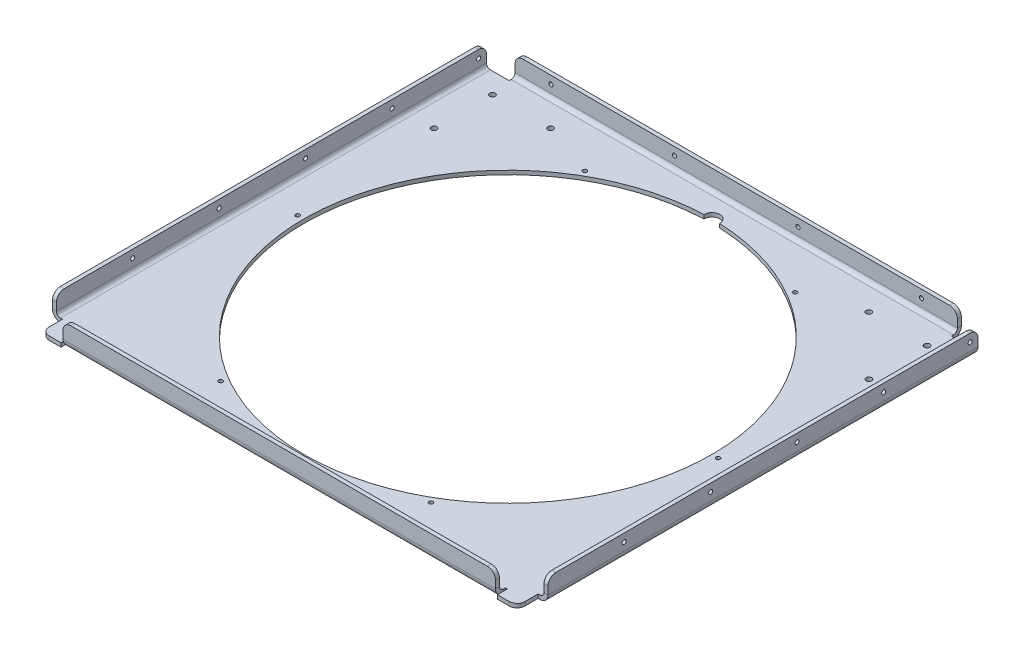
ISO-10303-21;
HEADER;
FILE_DESCRIPTION(('STEP AP214'),'2;1');
FILE_NAME('part.step','',(''),(''),'','','');
FILE_SCHEMA(('AUTOMOTIVE_DESIGN { 1 0 10303 214 1 1 1 1 }'));
ENDSEC;
DATA;
#1=APPLICATION_CONTEXT('core data for automotive mechanical design processes');
#2=APPLICATION_PROTOCOL_DEFINITION('international standard','automotive_design',2000,#1);
#3=PRODUCT_CONTEXT('',#1,'mechanical');
#4=PRODUCT('Part','Part','',(#3));
#5=PRODUCT_RELATED_PRODUCT_CATEGORY('part','',(#4));
#6=PRODUCT_DEFINITION_FORMATION('','',#4);
#7=PRODUCT_DEFINITION_CONTEXT('part definition',#1,'design');
#8=PRODUCT_DEFINITION('design','',#6,#7);
#9=PRODUCT_DEFINITION_SHAPE('','',#8);
#10=(LENGTH_UNIT() NAMED_UNIT(*) SI_UNIT(.MILLI.,.METRE.));
#11=(NAMED_UNIT(*) PLANE_ANGLE_UNIT() SI_UNIT($,.RADIAN.));
#12=(NAMED_UNIT(*) SI_UNIT($,.STERADIAN.) SOLID_ANGLE_UNIT());
#13=UNCERTAINTY_MEASURE_WITH_UNIT(LENGTH_MEASURE(1.E-05),#10,'distance_accuracy_value','');
#14=(GEOMETRIC_REPRESENTATION_CONTEXT(3) GLOBAL_UNCERTAINTY_ASSIGNED_CONTEXT((#13)) GLOBAL_UNIT_ASSIGNED_CONTEXT((#10,
#11,#12)) REPRESENTATION_CONTEXT('',''));
#15=CARTESIAN_POINT('',(0.,0.,0.));
#16=DIRECTION('',(0.,0.,1.));
#17=DIRECTION('',(1.,0.,0.));
#18=AXIS2_PLACEMENT_3D('',#15,#16,#17);
#19=CARTESIAN_POINT('',(0.,-3.175,0.));
#20=DIRECTION('',(0.,1.,0.));
#21=DIRECTION('',(0.,0.,1.));
#22=AXIS2_PLACEMENT_3D('',#19,#20,#21);
#23=PLANE('',#22);
#24=CARTESIAN_POINT('',(175.896169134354,-3.175,-163.39616895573));
#25=DIRECTION('',(0.,-1.,0.));
#26=DIRECTION('',(0.,0.,-1.));
#27=AXIS2_PLACEMENT_3D('',#24,#25,#26);
#28=CIRCLE('',#27,2.24999999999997);
#29=CARTESIAN_POINT('',(175.896169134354,-3.175,-165.64616895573));
#30=VERTEX_POINT('',#29);
#31=EDGE_CURVE('E2214',#30,#30,#28,.T.);
#32=ORIENTED_EDGE('',*,*,#31,.F.);
#33=EDGE_LOOP('',(#32));
#34=FACE_BOUND('',#33,.T.);
#35=CARTESIAN_POINT('',(175.89616884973,-3.175,-116.253792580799));
#36=DIRECTION('',(0.,-1.,0.));
#37=DIRECTION('',(0.,0.,-1.));
#38=AXIS2_PLACEMENT_3D('',#35,#36,#37);
#39=CIRCLE('',#38,2.24999999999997);
#40=CARTESIAN_POINT('',(175.89616884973,-3.175,-118.503792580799));
#41=VERTEX_POINT('',#40);
#42=EDGE_CURVE('E2227',#41,#41,#39,.T.);
#43=ORIENTED_EDGE('',*,*,#42,.F.);
#44=EDGE_LOOP('',(#43));
#45=FACE_BOUND('',#44,.T.);
#46=CARTESIAN_POINT('',(128.753792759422,-3.175,-163.396169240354));
#47=DIRECTION('',(0.,-1.,0.));
#48=DIRECTION('',(0.,0.,-1.));
#49=AXIS2_PLACEMENT_3D('',#46,#47,#48);
#50=CIRCLE('',#49,2.24999999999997);
#51=CARTESIAN_POINT('',(128.753792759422,-3.175,-165.646169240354));
#52=VERTEX_POINT('',#51);
#53=EDGE_CURVE('E2233',#52,#52,#50,.T.);
#54=ORIENTED_EDGE('',*,*,#53,.F.);
#55=EDGE_LOOP('',(#54));
#56=FACE_BOUND('',#55,.T.);
#57=CARTESIAN_POINT('',(-128.753811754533,-3.175,-163.396188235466));
#58=DIRECTION('',(0.,-1.,0.));
#59=DIRECTION('',(0.,0.,-1.));
#60=AXIS2_PLACEMENT_3D('',#57,#58,#59);
#61=CIRCLE('',#60,2.25);
#62=CARTESIAN_POINT('',(-128.753811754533,-3.175,-165.646188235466));
#63=VERTEX_POINT('',#62);
#64=EDGE_CURVE('E2239',#63,#63,#61,.T.);
#65=ORIENTED_EDGE('',*,*,#64,.F.);
#66=EDGE_LOOP('',(#65));
#67=FACE_BOUND('',#66,.T.);
#68=CARTESIAN_POINT('',(-175.896188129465,-3.175,-163.396188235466));
#69=DIRECTION('',(0.,-1.,0.));
#70=DIRECTION('',(0.,0.,-1.));
#71=AXIS2_PLACEMENT_3D('',#68,#69,#70);
#72=CIRCLE('',#71,2.25);
#73=CARTESIAN_POINT('',(-175.896188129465,-3.175,-165.646188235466));
#74=VERTEX_POINT('',#73);
#75=EDGE_CURVE('E2245',#74,#74,#72,.T.);
#76=ORIENTED_EDGE('',*,*,#75,.F.);
#77=EDGE_LOOP('',(#76));
#78=FACE_BOUND('',#77,.T.);
#79=CARTESIAN_POINT('',(-175.896188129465,-3.175,-116.253811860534));
#80=DIRECTION('',(0.,-1.,0.));
#81=DIRECTION('',(0.,0.,-1.));
#82=AXIS2_PLACEMENT_3D('',#79,#80,#81);
#83=CIRCLE('',#82,2.25);
#84=CARTESIAN_POINT('',(-175.896188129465,-3.175,-118.503811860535));
#85=VERTEX_POINT('',#84);
#86=EDGE_CURVE('E2251',#85,#85,#83,.T.);
#87=ORIENTED_EDGE('',*,*,#86,.F.);
#88=EDGE_LOOP('',(#87));
#89=FACE_BOUND('',#88,.T.);
#90=DIRECTION('',(1.,0.,0.));
#91=VECTOR('',#90,1.);
#92=CARTESIAN_POINT('',(-200.499999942,-3.175,185.039999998));
#93=LINE('',#92,#91);
#94=CARTESIAN_POINT('',(-186.149999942,-3.175,185.039999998));
#95=VERTEX_POINT('',#94);
#96=CARTESIAN_POINT('',(-176.5875,-3.175,185.039999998));
#97=VERTEX_POINT('',#96);
#98=EDGE_CURVE('E482',#95,#97,#93,.T.);
#99=ORIENTED_EDGE('',*,*,#98,.F.);
#100=CARTESIAN_POINT('',(-186.149999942,-3.175,178.689999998));
#101=DIRECTION('',(0.,1.,0.));
#102=DIRECTION('',(0.,0.,1.));
#103=AXIS2_PLACEMENT_3D('',#100,#101,#102);
#104=CIRCLE('',#103,6.35);
#105=CARTESIAN_POINT('',(-192.499999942,-3.175,178.689999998));
#106=VERTEX_POINT('',#105);
#107=EDGE_CURVE('E564',#95,#106,#104,.F.);
#108=ORIENTED_EDGE('',*,*,#107,.T.);
#109=DIRECTION('',(0.,0.,1.));
#110=VECTOR('',#109,1.);
#111=CARTESIAN_POINT('',(-192.499999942,-3.175,185.039999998));
#112=LINE('',#111,#110);
#113=CARTESIAN_POINT('',(-192.499999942,-3.175,168.03999996));
#114=VERTEX_POINT('',#113);
#115=EDGE_CURVE('E849',#114,#106,#112,.T.);
#116=ORIENTED_EDGE('',*,*,#115,.F.);
#117=DIRECTION('',(1.,0.,0.));
#118=VECTOR('',#117,1.);
#119=CARTESIAN_POINT('',(-200.499999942,-3.175,168.03999996));
#120=LINE('',#119,#118);
#121=CARTESIAN_POINT('',(-194.149999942,-3.17500000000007,168.03999996));
#122=VERTEX_POINT('',#121);
#123=EDGE_CURVE('E841',#122,#114,#120,.T.);
#124=ORIENTED_EDGE('',*,*,#123,.F.);
#125=DIRECTION('',(0.,0.,1.));
#126=VECTOR('',#125,1.);
#127=CARTESIAN_POINT('',(-194.149999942,-3.17500000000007,168.03999996));
#128=LINE('',#127,#126);
#129=CARTESIAN_POINT('',(-194.149999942,-3.175,-180.000000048));
#130=VERTEX_POINT('',#129);
#131=EDGE_CURVE('E764',#122,#130,#128,.F.);
#132=ORIENTED_EDGE('',*,*,#131,.T.);
#133=DIRECTION('',(-1.,0.,0.));
#134=VECTOR('',#133,1.);
#135=CARTESIAN_POINT('',(-200.499999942,-3.175,-180.000000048));
#136=LINE('',#135,#134);
#137=CARTESIAN_POINT('',(-179.,-3.175,-180.000000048));
#138=VERTEX_POINT('',#137);
#139=EDGE_CURVE('E484',#138,#130,#136,.T.);
#140=ORIENTED_EDGE('',*,*,#139,.F.);
#141=DIRECTION('',(0.,0.,1.));
#142=VECTOR('',#141,1.);
#143=CARTESIAN_POINT('',(-179.,-3.17500000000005,-181.650000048));
#144=LINE('',#143,#142);
#145=CARTESIAN_POINT('',(-179.,-3.17500000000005,-181.650000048));
#146=VERTEX_POINT('',#145);
#147=EDGE_CURVE('E935',#146,#138,#144,.T.);
#148=ORIENTED_EDGE('',*,*,#147,.F.);
#149=DIRECTION('',(-1.,0.,0.));
#150=VECTOR('',#149,1.);
#151=CARTESIAN_POINT('',(-179.,-3.17500000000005,-181.650000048));
#152=LINE('',#151,#150);
#153=CARTESIAN_POINT('',(179.,-3.17500000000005,-181.650000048));
#154=VERTEX_POINT('',#153);
#155=EDGE_CURVE('E904',#146,#154,#152,.F.);
#156=ORIENTED_EDGE('',*,*,#155,.T.);
#157=DIRECTION('',(0.,0.,1.));
#158=VECTOR('',#157,1.);
#159=CARTESIAN_POINT('',(179.,-3.17500000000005,-181.650000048));
#160=LINE('',#159,#158);
#161=CARTESIAN_POINT('',(179.,-3.17500000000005,-180.000000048));
#162=VERTEX_POINT('',#161);
#163=EDGE_CURVE('E932',#154,#162,#160,.T.);
#164=ORIENTED_EDGE('',*,*,#163,.T.);
#165=CARTESIAN_POINT('',(194.149999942,-3.17499999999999,-180.000000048));
#166=VERTEX_POINT('',#165);
#167=EDGE_CURVE('E486',#166,#162,#136,.T.);
#168=ORIENTED_EDGE('',*,*,#167,.F.);
#169=DIRECTION('',(0.,0.,-1.));
#170=VECTOR('',#169,1.);
#171=CARTESIAN_POINT('',(194.149999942,-3.17499999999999,-180.000000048));
#172=LINE('',#171,#170);
#173=CARTESIAN_POINT('',(194.149999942,-3.175,168.03999996));
#174=VERTEX_POINT('',#173);
#175=EDGE_CURVE('E814',#166,#174,#172,.F.);
#176=ORIENTED_EDGE('',*,*,#175,.T.);
#177=DIRECTION('',(1.,0.,0.));
#178=VECTOR('',#177,1.);
#179=CARTESIAN_POINT('',(200.499999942,-3.175,168.03999996));
#180=LINE('',#179,#178);
#181=CARTESIAN_POINT('',(192.499999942,-3.175,168.03999996));
#182=VERTEX_POINT('',#181);
#183=EDGE_CURVE('E840',#182,#174,#180,.T.);
#184=ORIENTED_EDGE('',*,*,#183,.F.);
#185=DIRECTION('',(0.,0.,-1.));
#186=VECTOR('',#185,1.);
#187=CARTESIAN_POINT('',(192.499999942,-3.175,185.039999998));
#188=LINE('',#187,#186);
#189=CARTESIAN_POINT('',(192.499999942,-3.175,178.689999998));
#190=VERTEX_POINT('',#189);
#191=EDGE_CURVE('E838',#190,#182,#188,.T.);
#192=ORIENTED_EDGE('',*,*,#191,.F.);
#193=CARTESIAN_POINT('',(186.149999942,-3.175,178.689999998));
#194=DIRECTION('',(0.,1.,0.));
#195=DIRECTION('',(0.,0.,1.));
#196=AXIS2_PLACEMENT_3D('',#193,#194,#195);
#197=CIRCLE('',#196,6.35);
#198=CARTESIAN_POINT('',(186.149999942,-3.175,185.039999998));
#199=VERTEX_POINT('',#198);
#200=EDGE_CURVE('E562',#190,#199,#197,.F.);
#201=ORIENTED_EDGE('',*,*,#200,.T.);
#202=CARTESIAN_POINT('',(176.5875,-3.175,185.039999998));
#203=VERTEX_POINT('',#202);
#204=EDGE_CURVE('E485',#203,#199,#93,.T.);
#205=ORIENTED_EDGE('',*,*,#204,.F.);
#206=DIRECTION('',(0.,0.,1.));
#207=VECTOR('',#206,1.);
#208=CARTESIAN_POINT('',(176.587499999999,-3.175,-6.17485065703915E-13));
#209=LINE('',#208,#207);
#210=CARTESIAN_POINT('',(176.5875,-3.175,177.102499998));
#211=VERTEX_POINT('',#210);
#212=EDGE_CURVE('E695',#211,#203,#209,.T.);
#213=ORIENTED_EDGE('',*,*,#212,.F.);
#214=DIRECTION('',(1.,0.,0.));
#215=VECTOR('',#214,1.);
#216=CARTESIAN_POINT('',(0.,-3.175,177.102499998));
#217=LINE('',#216,#215);
#218=CARTESIAN_POINT('',(175.,-3.175,177.102499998));
#219=VERTEX_POINT('',#218);
#220=EDGE_CURVE('E703',#219,#211,#217,.T.);
#221=ORIENTED_EDGE('',*,*,#220,.F.);
#222=DIRECTION('',(0.,0.,-1.));
#223=VECTOR('',#222,1.);
#224=CARTESIAN_POINT('',(175.,-3.175,0.));
#225=LINE('',#224,#223);
#226=CARTESIAN_POINT('',(175.,-3.17500000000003,178.689999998));
#227=VERTEX_POINT('',#226);
#228=EDGE_CURVE('E701',#227,#219,#225,.T.);
#229=ORIENTED_EDGE('',*,*,#228,.F.);
#230=DIRECTION('',(1.,0.,0.));
#231=VECTOR('',#230,1.);
#232=CARTESIAN_POINT('',(175.,-3.17500000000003,178.689999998));
#233=LINE('',#232,#231);
#234=CARTESIAN_POINT('',(-175.,-3.175,178.689999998));
#235=VERTEX_POINT('',#234);
#236=EDGE_CURVE('E634',#227,#235,#233,.F.);
#237=ORIENTED_EDGE('',*,*,#236,.T.);
#238=DIRECTION('',(0.,0.,1.));
#239=VECTOR('',#238,1.);
#240=CARTESIAN_POINT('',(-175.,-3.175,0.));
#241=LINE('',#240,#239);
#242=CARTESIAN_POINT('',(-175.,-3.175,177.102499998));
#243=VERTEX_POINT('',#242);
#244=EDGE_CURVE('E699',#243,#235,#241,.T.);
#245=ORIENTED_EDGE('',*,*,#244,.F.);
#246=DIRECTION('',(1.,0.,0.));
#247=VECTOR('',#246,1.);
#248=CARTESIAN_POINT('',(0.,-3.175,177.102499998));
#249=LINE('',#248,#247);
#250=CARTESIAN_POINT('',(-176.5875,-3.175,177.102499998));
#251=VERTEX_POINT('',#250);
#252=EDGE_CURVE('E697',#251,#243,#249,.T.);
#253=ORIENTED_EDGE('',*,*,#252,.F.);
#254=DIRECTION('',(0.,0.,-1.));
#255=VECTOR('',#254,1.);
#256=CARTESIAN_POINT('',(-176.5875,-3.175,0.));
#257=LINE('',#256,#255);
#258=EDGE_CURVE('E662',#97,#251,#257,.T.);
#259=ORIENTED_EDGE('',*,*,#258,.F.);
#260=EDGE_LOOP('',(#99,#108,#116,#124,#132,#140,#148,#156,#164,#168,#176,#184,#192,#201,#205,
#213,#221,#229,#237,#245,#253,#259));
#261=FACE_BOUND('',#260,.T.);
#262=CARTESIAN_POINT('',(-85.0900000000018,-3.175,147.380203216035));
#263=DIRECTION('',(0.,-1.,0.));
#264=DIRECTION('',(-0.866025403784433,0.,-0.50000000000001));
#265=AXIS2_PLACEMENT_3D('',#262,#263,#264);
#266=CIRCLE('',#265,1.64999999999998);
#267=CARTESIAN_POINT('',(-86.518941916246,-3.175,146.555203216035));
#268=VERTEX_POINT('',#267);
#269=EDGE_CURVE('E723',#268,#268,#266,.T.);
#270=ORIENTED_EDGE('',*,*,#269,.F.);
#271=EDGE_LOOP('',(#270));
#272=FACE_BOUND('',#271,.T.);
#273=CARTESIAN_POINT('',(85.0899999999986,-3.175,147.380203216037));
#274=DIRECTION('',(0.,-1.,0.));
#275=DIRECTION('',(-0.866025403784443,0.,0.499999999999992));
#276=AXIS2_PLACEMENT_3D('',#273,#274,#275);
#277=CIRCLE('',#276,1.64999999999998);
#278=CARTESIAN_POINT('',(83.6610580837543,-3.175,148.205203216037));
#279=VERTEX_POINT('',#278);
#280=EDGE_CURVE('E717',#279,#279,#277,.T.);
#281=ORIENTED_EDGE('',*,*,#280,.F.);
#282=EDGE_LOOP('',(#281));
#283=FACE_BOUND('',#282,.T.);
#284=CARTESIAN_POINT('',(170.18,-3.175,0.));
#285=DIRECTION('',(0.,-1.,0.));
#286=DIRECTION('',(0.,0.,1.));
#287=AXIS2_PLACEMENT_3D('',#284,#285,#286);
#288=CIRCLE('',#287,1.64999999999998);
#289=CARTESIAN_POINT('',(170.18,-3.175,1.65000000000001));
#290=VERTEX_POINT('',#289);
#291=EDGE_CURVE('E710',#290,#290,#288,.T.);
#292=ORIENTED_EDGE('',*,*,#291,.F.);
#293=EDGE_LOOP('',(#292));
#294=FACE_BOUND('',#293,.T.);
#295=CARTESIAN_POINT('',(85.0900000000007,-3.175,-147.380203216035));
#296=DIRECTION('',(0.,-1.,0.));
#297=DIRECTION('',(0.866025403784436,0.,0.500000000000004));
#298=AXIS2_PLACEMENT_3D('',#295,#296,#297);
#299=CIRCLE('',#298,1.64999999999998);
#300=CARTESIAN_POINT('',(86.518941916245,-3.175,-146.555203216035));
#301=VERTEX_POINT('',#300);
#302=EDGE_CURVE('E709',#301,#301,#299,.T.);
#303=ORIENTED_EDGE('',*,*,#302,.F.);
#304=EDGE_LOOP('',(#303));
#305=FACE_BOUND('',#304,.T.);
#306=CARTESIAN_POINT('',(-85.0899999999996,-3.175,-147.380203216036));
#307=DIRECTION('',(0.,-1.,0.));
#308=DIRECTION('',(0.86602540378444,0.,-0.499999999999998));
#309=AXIS2_PLACEMENT_3D('',#306,#307,#308);
#310=CIRCLE('',#309,1.64999999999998);
#311=CARTESIAN_POINT('',(-83.6610580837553,-3.175,-148.205203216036));
#312=VERTEX_POINT('',#311);
#313=EDGE_CURVE('E732',#312,#312,#310,.T.);
#314=ORIENTED_EDGE('',*,*,#313,.F.);
#315=EDGE_LOOP('',(#314));
#316=FACE_BOUND('',#315,.T.);
#317=CARTESIAN_POINT('',(-170.18,-3.175,0.));
#318=DIRECTION('',(0.,-1.,0.));
#319=DIRECTION('',(0.,0.,-1.));
#320=AXIS2_PLACEMENT_3D('',#317,#318,#319);
#321=CIRCLE('',#320,1.64999999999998);
#322=CARTESIAN_POINT('',(-170.18,-3.175,-1.65000000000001));
#323=VERTEX_POINT('',#322);
#324=EDGE_CURVE('E559',#323,#323,#321,.T.);
#325=ORIENTED_EDGE('',*,*,#324,.F.);
#326=EDGE_LOOP('',(#325));
#327=FACE_BOUND('',#326,.T.);
#328=DIRECTION('',(0.,0.,1.));
#329=VECTOR('',#328,1.);
#330=CARTESIAN_POINT('',(-6.35,-3.175,0.));
#331=LINE('',#330,#329);
#332=CARTESIAN_POINT('',(-6.35,-3.175,-165.1));
#333=VERTEX_POINT('',#332);
#334=CARTESIAN_POINT('',(-6.35,-3.175,-164.977839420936));
#335=VERTEX_POINT('',#334);
#336=EDGE_CURVE('E452',#333,#335,#331,.T.);
#337=ORIENTED_EDGE('',*,*,#336,.T.);
#338=CARTESIAN_POINT('',(0.,-3.175,0.));
#339=DIRECTION('',(0.,1.,0.));
#340=DIRECTION('',(0.,0.,1.));
#341=AXIS2_PLACEMENT_3D('',#338,#339,#340);
#342=CIRCLE('',#341,165.1);
#343=CARTESIAN_POINT('',(6.35,-3.175,-164.977839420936));
#344=VERTEX_POINT('',#343);
#345=EDGE_CURVE('E466',#335,#344,#342,.T.);
#346=ORIENTED_EDGE('',*,*,#345,.T.);
#347=DIRECTION('',(0.,0.,1.));
#348=VECTOR('',#347,1.);
#349=CARTESIAN_POINT('',(6.35,-3.175,0.));
#350=LINE('',#349,#348);
#351=CARTESIAN_POINT('',(6.35,-3.175,-165.1));
#352=VERTEX_POINT('',#351);
#353=EDGE_CURVE('E144',#344,#352,#350,.F.);
#354=ORIENTED_EDGE('',*,*,#353,.T.);
#355=CARTESIAN_POINT('',(0.,-3.175,-165.1));
#356=DIRECTION('',(0.,1.,0.));
#357=DIRECTION('',(0.,0.,1.));
#358=AXIS2_PLACEMENT_3D('',#355,#356,#357);
#359=CIRCLE('',#358,6.35);
#360=EDGE_CURVE('E467',#352,#333,#359,.T.);
#361=ORIENTED_EDGE('',*,*,#360,.T.);
#362=EDGE_LOOP('',(#337,#346,#354,#361));
#363=FACE_BOUND('',#362,.T.);
#364=ADVANCED_FACE('F129',(#34,#45,#56,#67,#78,#89,#261,#272,#283,#294,#305,#316,#327,#363),#23,.F.);
#365=CARTESIAN_POINT('',(0.,0.,0.));
#366=DIRECTION('',(0.,1.,0.));
#367=DIRECTION('',(0.,0.,1.));
#368=AXIS2_PLACEMENT_3D('',#365,#366,#367);
#369=PLANE('',#368);
#370=CARTESIAN_POINT('',(175.896169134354,0.,-163.39616895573));
#371=DIRECTION('',(0.,1.,0.));
#372=DIRECTION('',(0.,0.,1.));
#373=AXIS2_PLACEMENT_3D('',#370,#371,#372);
#374=CIRCLE('',#373,2.24999999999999);
#375=CARTESIAN_POINT('',(175.896169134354,0.,-161.14616895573));
#376=VERTEX_POINT('',#375);
#377=EDGE_CURVE('E2224',#376,#376,#374,.T.);
#378=ORIENTED_EDGE('',*,*,#377,.F.);
#379=EDGE_LOOP('',(#378));
#380=FACE_BOUND('',#379,.T.);
#381=CARTESIAN_POINT('',(175.89616884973,0.,-116.253792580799));
#382=DIRECTION('',(0.,1.,0.));
#383=DIRECTION('',(0.,0.,1.));
#384=AXIS2_PLACEMENT_3D('',#381,#382,#383);
#385=CIRCLE('',#384,2.24999999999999);
#386=CARTESIAN_POINT('',(175.89616884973,0.,-114.003792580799));
#387=VERTEX_POINT('',#386);
#388=EDGE_CURVE('E2230',#387,#387,#385,.T.);
#389=ORIENTED_EDGE('',*,*,#388,.F.);
#390=EDGE_LOOP('',(#389));
#391=FACE_BOUND('',#390,.T.);
#392=CARTESIAN_POINT('',(128.753792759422,0.,-163.396169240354));
#393=DIRECTION('',(0.,1.,0.));
#394=DIRECTION('',(0.,0.,1.));
#395=AXIS2_PLACEMENT_3D('',#392,#393,#394);
#396=CIRCLE('',#395,2.24999999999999);
#397=CARTESIAN_POINT('',(128.753792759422,0.,-161.146169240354));
#398=VERTEX_POINT('',#397);
#399=EDGE_CURVE('E2236',#398,#398,#396,.T.);
#400=ORIENTED_EDGE('',*,*,#399,.F.);
#401=EDGE_LOOP('',(#400));
#402=FACE_BOUND('',#401,.T.);
#403=CARTESIAN_POINT('',(-128.753811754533,0.,-163.396188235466));
#404=DIRECTION('',(0.,1.,0.));
#405=DIRECTION('',(0.,0.,1.));
#406=AXIS2_PLACEMENT_3D('',#403,#404,#405);
#407=CIRCLE('',#406,2.25);
#408=CARTESIAN_POINT('',(-128.753811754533,0.,-161.146188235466));
#409=VERTEX_POINT('',#408);
#410=EDGE_CURVE('E2242',#409,#409,#407,.T.);
#411=ORIENTED_EDGE('',*,*,#410,.F.);
#412=EDGE_LOOP('',(#411));
#413=FACE_BOUND('',#412,.T.);
#414=CARTESIAN_POINT('',(-175.896188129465,0.,-163.396188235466));
#415=DIRECTION('',(0.,1.,0.));
#416=DIRECTION('',(0.,0.,1.));
#417=AXIS2_PLACEMENT_3D('',#414,#415,#416);
#418=CIRCLE('',#417,2.25);
#419=CARTESIAN_POINT('',(-175.896188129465,0.,-161.146188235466));
#420=VERTEX_POINT('',#419);
#421=EDGE_CURVE('E2248',#420,#420,#418,.T.);
#422=ORIENTED_EDGE('',*,*,#421,.F.);
#423=EDGE_LOOP('',(#422));
#424=FACE_BOUND('',#423,.T.);
#425=CARTESIAN_POINT('',(-175.896188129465,0.,-116.253811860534));
#426=DIRECTION('',(0.,1.,0.));
#427=DIRECTION('',(0.,0.,1.));
#428=AXIS2_PLACEMENT_3D('',#425,#426,#427);
#429=CIRCLE('',#428,2.25);
#430=CARTESIAN_POINT('',(-175.896188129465,0.,-114.003811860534));
#431=VERTEX_POINT('',#430);
#432=EDGE_CURVE('E2254',#431,#431,#429,.T.);
#433=ORIENTED_EDGE('',*,*,#432,.F.);
#434=EDGE_LOOP('',(#433));
#435=FACE_BOUND('',#434,.T.);
#436=CARTESIAN_POINT('',(-85.0900000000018,0.,147.380203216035));
#437=DIRECTION('',(0.,1.,0.));
#438=DIRECTION('',(0.866025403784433,0.,0.50000000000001));
#439=AXIS2_PLACEMENT_3D('',#436,#437,#438);
#440=CIRCLE('',#439,1.64999999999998);
#441=CARTESIAN_POINT('',(-83.6610580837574,0.,148.205203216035));
#442=VERTEX_POINT('',#441);
#443=EDGE_CURVE('E705',#442,#442,#440,.T.);
#444=ORIENTED_EDGE('',*,*,#443,.F.);
#445=EDGE_LOOP('',(#444));
#446=FACE_BOUND('',#445,.T.);
#447=CARTESIAN_POINT('',(85.0899999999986,0.,147.380203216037));
#448=DIRECTION('',(0.,1.,0.));
#449=DIRECTION('',(0.866025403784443,0.,-0.499999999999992));
#450=AXIS2_PLACEMENT_3D('',#447,#448,#449);
#451=CIRCLE('',#450,1.64999999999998);
#452=CARTESIAN_POINT('',(86.5189419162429,0.,146.555203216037));
#453=VERTEX_POINT('',#452);
#454=EDGE_CURVE('E720',#453,#453,#451,.T.);
#455=ORIENTED_EDGE('',*,*,#454,.F.);
#456=EDGE_LOOP('',(#455));
#457=FACE_BOUND('',#456,.T.);
#458=CARTESIAN_POINT('',(170.18,0.,0.));
#459=DIRECTION('',(0.,1.,0.));
#460=DIRECTION('',(0.,0.,-1.));
#461=AXIS2_PLACEMENT_3D('',#458,#459,#460);
#462=CIRCLE('',#461,1.64999999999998);
#463=CARTESIAN_POINT('',(170.18,0.,-1.64999999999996));
#464=VERTEX_POINT('',#463);
#465=EDGE_CURVE('E714',#464,#464,#462,.T.);
#466=ORIENTED_EDGE('',*,*,#465,.F.);
#467=EDGE_LOOP('',(#466));
#468=FACE_BOUND('',#467,.T.);
#469=CARTESIAN_POINT('',(85.0900000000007,0.,-147.380203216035));
#470=DIRECTION('',(0.,1.,0.));
#471=DIRECTION('',(-0.866025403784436,0.,-0.500000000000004));
#472=AXIS2_PLACEMENT_3D('',#469,#470,#471);
#473=CIRCLE('',#472,1.64999999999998);
#474=CARTESIAN_POINT('',(83.6610580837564,0.,-148.205203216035));
#475=VERTEX_POINT('',#474);
#476=EDGE_CURVE('E706',#475,#475,#473,.T.);
#477=ORIENTED_EDGE('',*,*,#476,.F.);
#478=EDGE_LOOP('',(#477));
#479=FACE_BOUND('',#478,.T.);
#480=CARTESIAN_POINT('',(-85.0899999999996,0.,-147.380203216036));
#481=DIRECTION('',(0.,1.,0.));
#482=DIRECTION('',(-0.86602540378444,0.,0.499999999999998));
#483=AXIS2_PLACEMENT_3D('',#480,#481,#482);
#484=CIRCLE('',#483,1.64999999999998);
#485=CARTESIAN_POINT('',(-86.5189419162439,0.,-146.555203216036));
#486=VERTEX_POINT('',#485);
#487=EDGE_CURVE('E713',#486,#486,#484,.T.);
#488=ORIENTED_EDGE('',*,*,#487,.F.);
#489=EDGE_LOOP('',(#488));
#490=FACE_BOUND('',#489,.T.);
#491=CARTESIAN_POINT('',(-170.18,0.,0.));
#492=DIRECTION('',(0.,1.,0.));
#493=DIRECTION('',(0.,0.,1.));
#494=AXIS2_PLACEMENT_3D('',#491,#492,#493);
#495=CIRCLE('',#494,1.64999999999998);
#496=CARTESIAN_POINT('',(-170.18,0.,1.64999999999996));
#497=VERTEX_POINT('',#496);
#498=EDGE_CURVE('E555',#497,#497,#495,.T.);
#499=ORIENTED_EDGE('',*,*,#498,.F.);
#500=EDGE_LOOP('',(#499));
#501=FACE_BOUND('',#500,.T.);
#502=DIRECTION('',(0.,0.,-1.));
#503=VECTOR('',#502,1.);
#504=CARTESIAN_POINT('',(-192.499999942,0.,0.));
#505=LINE('',#504,#503);
#506=CARTESIAN_POINT('',(-192.499999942,0.,178.689999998));
#507=VERTEX_POINT('',#506);
#508=CARTESIAN_POINT('',(-192.499999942,0.,168.03999996));
#509=VERTEX_POINT('',#508);
#510=EDGE_CURVE('E511',#507,#509,#505,.T.);
#511=ORIENTED_EDGE('',*,*,#510,.F.);
#512=CARTESIAN_POINT('',(-186.149999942,0.,178.689999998));
#513=DIRECTION('',(0.,1.,0.));
#514=DIRECTION('',(0.,0.,1.));
#515=AXIS2_PLACEMENT_3D('',#512,#513,#514);
#516=CIRCLE('',#515,6.35);
#517=CARTESIAN_POINT('',(-186.149999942,0.,185.039999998));
#518=VERTEX_POINT('',#517);
#519=EDGE_CURVE('E570',#507,#518,#516,.T.);
#520=ORIENTED_EDGE('',*,*,#519,.T.);
#521=DIRECTION('',(1.,0.,0.));
#522=VECTOR('',#521,1.);
#523=CARTESIAN_POINT('',(-200.499999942,0.,185.039999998));
#524=LINE('',#523,#522);
#525=CARTESIAN_POINT('',(-176.5875,0.,185.039999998));
#526=VERTEX_POINT('',#525);
#527=EDGE_CURVE('E474',#518,#526,#524,.T.);
#528=ORIENTED_EDGE('',*,*,#527,.T.);
#529=DIRECTION('',(0.,0.,1.));
#530=VECTOR('',#529,1.);
#531=CARTESIAN_POINT('',(-176.5875,0.,177.102499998));
#532=LINE('',#531,#530);
#533=CARTESIAN_POINT('',(-176.5875,0.,177.102499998));
#534=VERTEX_POINT('',#533);
#535=EDGE_CURVE('E678',#534,#526,#532,.T.);
#536=ORIENTED_EDGE('',*,*,#535,.F.);
#537=DIRECTION('',(-1.,0.,0.));
#538=VECTOR('',#537,1.);
#539=CARTESIAN_POINT('',(-175.,0.,177.102499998));
#540=LINE('',#539,#538);
#541=CARTESIAN_POINT('',(-175.,0.,177.102499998));
#542=VERTEX_POINT('',#541);
#543=EDGE_CURVE('E674',#542,#534,#540,.T.);
#544=ORIENTED_EDGE('',*,*,#543,.F.);
#545=DIRECTION('',(0.,0.,-1.));
#546=VECTOR('',#545,1.);
#547=CARTESIAN_POINT('',(-175.,0.,178.689999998));
#548=LINE('',#547,#546);
#549=CARTESIAN_POINT('',(-175.,0.,178.689999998));
#550=VERTEX_POINT('',#549);
#551=EDGE_CURVE('E671',#550,#542,#548,.T.);
#552=ORIENTED_EDGE('',*,*,#551,.F.);
#553=DIRECTION('',(1.,0.,0.));
#554=VECTOR('',#553,1.);
#555=CARTESIAN_POINT('',(175.,0.,178.689999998));
#556=LINE('',#555,#554);
#557=CARTESIAN_POINT('',(175.,0.,178.689999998));
#558=VERTEX_POINT('',#557);
#559=EDGE_CURVE('E647',#558,#550,#556,.F.);
#560=ORIENTED_EDGE('',*,*,#559,.F.);
#561=DIRECTION('',(0.,0.,1.));
#562=VECTOR('',#561,1.);
#563=CARTESIAN_POINT('',(175.,0.,177.102499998));
#564=LINE('',#563,#562);
#565=CARTESIAN_POINT('',(175.,0.,177.102499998));
#566=VERTEX_POINT('',#565);
#567=EDGE_CURVE('E668',#566,#558,#564,.T.);
#568=ORIENTED_EDGE('',*,*,#567,.F.);
#569=DIRECTION('',(-1.,0.,0.));
#570=VECTOR('',#569,1.);
#571=CARTESIAN_POINT('',(176.5875,0.,177.102499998));
#572=LINE('',#571,#570);
#573=CARTESIAN_POINT('',(176.5875,0.,177.102499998));
#574=VERTEX_POINT('',#573);
#575=EDGE_CURVE('E664',#574,#566,#572,.T.);
#576=ORIENTED_EDGE('',*,*,#575,.F.);
#577=DIRECTION('',(0.,0.,-1.));
#578=VECTOR('',#577,1.);
#579=CARTESIAN_POINT('',(176.5875,0.,185.039999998));
#580=LINE('',#579,#578);
#581=CARTESIAN_POINT('',(176.5875,0.,185.039999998));
#582=VERTEX_POINT('',#581);
#583=EDGE_CURVE('E659',#582,#574,#580,.T.);
#584=ORIENTED_EDGE('',*,*,#583,.F.);
#585=CARTESIAN_POINT('',(186.149999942,0.,185.039999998));
#586=VERTEX_POINT('',#585);
#587=EDGE_CURVE('E470',#582,#586,#524,.T.);
#588=ORIENTED_EDGE('',*,*,#587,.T.);
#589=CARTESIAN_POINT('',(186.149999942,0.,178.689999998));
#590=DIRECTION('',(0.,1.,0.));
#591=DIRECTION('',(0.,0.,1.));
#592=AXIS2_PLACEMENT_3D('',#589,#590,#591);
#593=CIRCLE('',#592,6.35);
#594=CARTESIAN_POINT('',(192.499999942,0.,178.689999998));
#595=VERTEX_POINT('',#594);
#596=EDGE_CURVE('E568',#586,#595,#593,.T.);
#597=ORIENTED_EDGE('',*,*,#596,.T.);
#598=DIRECTION('',(0.,0.,1.));
#599=VECTOR('',#598,1.);
#600=CARTESIAN_POINT('',(192.499999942,0.,0.));
#601=LINE('',#600,#599);
#602=CARTESIAN_POINT('',(192.499999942,0.,168.03999996));
#603=VERTEX_POINT('',#602);
#604=EDGE_CURVE('E513',#603,#595,#601,.T.);
#605=ORIENTED_EDGE('',*,*,#604,.F.);
#606=DIRECTION('',(-1.,0.,0.));
#607=VECTOR('',#606,1.);
#608=CARTESIAN_POINT('',(0.,0.,168.03999996));
#609=LINE('',#608,#607);
#610=CARTESIAN_POINT('',(194.149999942,0.,168.03999996));
#611=VERTEX_POINT('',#610);
#612=EDGE_CURVE('E516',#611,#603,#609,.T.);
#613=ORIENTED_EDGE('',*,*,#612,.F.);
#614=DIRECTION('',(0.,0.,-1.));
#615=VECTOR('',#614,1.);
#616=CARTESIAN_POINT('',(194.149999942,0.,-180.000000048));
#617=LINE('',#616,#615);
#618=CARTESIAN_POINT('',(194.149999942,0.,-180.000000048));
#619=VERTEX_POINT('',#618);
#620=EDGE_CURVE('E827',#619,#611,#617,.F.);
#621=ORIENTED_EDGE('',*,*,#620,.F.);
#622=DIRECTION('',(-1.,0.,0.));
#623=VECTOR('',#622,1.);
#624=CARTESIAN_POINT('',(-200.499999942,0.,-180.000000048));
#625=LINE('',#624,#623);
#626=CARTESIAN_POINT('',(179.,0.,-180.000000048));
#627=VERTEX_POINT('',#626);
#628=EDGE_CURVE('E490',#619,#627,#625,.T.);
#629=ORIENTED_EDGE('',*,*,#628,.T.);
#630=DIRECTION('',(0.,0.,1.));
#631=VECTOR('',#630,1.);
#632=CARTESIAN_POINT('',(179.,0.,-181.650000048));
#633=LINE('',#632,#631);
#634=CARTESIAN_POINT('',(179.,0.,-181.650000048));
#635=VERTEX_POINT('',#634);
#636=EDGE_CURVE('E479',#635,#627,#633,.T.);
#637=ORIENTED_EDGE('',*,*,#636,.F.);
#638=DIRECTION('',(-1.,0.,0.));
#639=VECTOR('',#638,1.);
#640=CARTESIAN_POINT('',(-179.,0.,-181.650000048));
#641=LINE('',#640,#639);
#642=CARTESIAN_POINT('',(-179.,0.,-181.650000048));
#643=VERTEX_POINT('',#642);
#644=EDGE_CURVE('E917',#643,#635,#641,.F.);
#645=ORIENTED_EDGE('',*,*,#644,.F.);
#646=DIRECTION('',(0.,0.,1.));
#647=VECTOR('',#646,1.);
#648=CARTESIAN_POINT('',(-179.,0.,-181.650000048));
#649=LINE('',#648,#647);
#650=CARTESIAN_POINT('',(-179.,0.,-180.000000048));
#651=VERTEX_POINT('',#650);
#652=EDGE_CURVE('E476',#643,#651,#649,.T.);
#653=ORIENTED_EDGE('',*,*,#652,.T.);
#654=CARTESIAN_POINT('',(-194.149999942,0.,-180.000000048));
#655=VERTEX_POINT('',#654);
#656=EDGE_CURVE('E489',#651,#655,#625,.T.);
#657=ORIENTED_EDGE('',*,*,#656,.T.);
#658=DIRECTION('',(0.,0.,1.));
#659=VECTOR('',#658,1.);
#660=CARTESIAN_POINT('',(-194.149999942,0.,168.03999996));
#661=LINE('',#660,#659);
#662=CARTESIAN_POINT('',(-194.149999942,0.,168.03999996));
#663=VERTEX_POINT('',#662);
#664=EDGE_CURVE('E776',#663,#655,#661,.F.);
#665=ORIENTED_EDGE('',*,*,#664,.F.);
#666=DIRECTION('',(-1.,0.,0.));
#667=VECTOR('',#666,1.);
#668=CARTESIAN_POINT('',(0.,0.,168.03999996));
#669=LINE('',#668,#667);
#670=EDGE_CURVE('E509',#509,#663,#669,.T.);
#671=ORIENTED_EDGE('',*,*,#670,.F.);
#672=EDGE_LOOP('',(#511,#520,#528,#536,#544,#552,#560,#568,#576,#584,#588,#597,#605,#613,#621,
#629,#637,#645,#653,#657,#665,#671));
#673=FACE_BOUND('',#672,.T.);
#674=CARTESIAN_POINT('',(0.,0.,0.));
#675=DIRECTION('',(0.,1.,0.));
#676=DIRECTION('',(0.,0.,1.));
#677=AXIS2_PLACEMENT_3D('',#674,#675,#676);
#678=CIRCLE('',#677,165.1);
#679=CARTESIAN_POINT('',(-6.35,0.,-164.977839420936));
#680=VERTEX_POINT('',#679);
#681=CARTESIAN_POINT('',(6.35,0.,-164.977839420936));
#682=VERTEX_POINT('',#681);
#683=EDGE_CURVE('E471',#680,#682,#678,.T.);
#684=ORIENTED_EDGE('',*,*,#683,.F.);
#685=DIRECTION('',(0.,0.,1.));
#686=VECTOR('',#685,1.);
#687=CARTESIAN_POINT('',(-6.35,0.,-165.1));
#688=LINE('',#687,#686);
#689=CARTESIAN_POINT('',(-6.35,0.,-165.1));
#690=VERTEX_POINT('',#689);
#691=EDGE_CURVE('E455',#690,#680,#688,.T.);
#692=ORIENTED_EDGE('',*,*,#691,.F.);
#693=CARTESIAN_POINT('',(0.,0.,-165.1));
#694=DIRECTION('',(0.,1.,0.));
#695=DIRECTION('',(0.,0.,1.));
#696=AXIS2_PLACEMENT_3D('',#693,#694,#695);
#697=CIRCLE('',#696,6.35);
#698=CARTESIAN_POINT('',(6.35,0.,-165.1));
#699=VERTEX_POINT('',#698);
#700=EDGE_CURVE('E2212',#699,#690,#697,.T.);
#701=ORIENTED_EDGE('',*,*,#700,.F.);
#702=DIRECTION('',(0.,0.,-1.));
#703=VECTOR('',#702,1.);
#704=CARTESIAN_POINT('',(6.35,0.,-165.1));
#705=LINE('',#704,#703);
#706=EDGE_CURVE('E2208',#682,#699,#705,.T.);
#707=ORIENTED_EDGE('',*,*,#706,.F.);
#708=EDGE_LOOP('',(#684,#692,#701,#707));
#709=FACE_BOUND('',#708,.T.);
#710=ADVANCED_FACE('F942',(#380,#391,#402,#413,#424,#435,#446,#457,#468,#479,#490,#501,#673,
#709),#369,.T.);
#711=CARTESIAN_POINT('',(0.,-3.175,0.));
#712=DIRECTION('',(0.,1.,0.));
#713=DIRECTION('',(0.,0.,1.));
#714=AXIS2_PLACEMENT_3D('',#711,#712,#713);
#715=CYLINDRICAL_SURFACE('',#714,165.1);
#716=DIRECTION('',(0.,1.,0.));
#717=VECTOR('',#716,1.);
#718=CARTESIAN_POINT('',(-6.35,0.,-164.977839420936));
#719=LINE('',#718,#717);
#720=EDGE_CURVE('E448',#680,#335,#719,.F.);
#721=ORIENTED_EDGE('',*,*,#720,.F.);
#722=ORIENTED_EDGE('',*,*,#683,.T.);
#723=DIRECTION('',(0.,1.,0.));
#724=VECTOR('',#723,1.);
#725=CARTESIAN_POINT('',(6.35,0.,-164.977839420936));
#726=LINE('',#725,#724);
#727=EDGE_CURVE('E461',#682,#344,#726,.F.);
#728=ORIENTED_EDGE('',*,*,#727,.T.);
#729=ORIENTED_EDGE('',*,*,#345,.F.);
#730=EDGE_LOOP('',(#721,#722,#728,#729));
#731=FACE_BOUND('',#730,.T.);
#732=ADVANCED_FACE('F469',(#731),#715,.F.);
#733=CARTESIAN_POINT('',(-200.499999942,-7.1218692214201E-13,0.));
#734=DIRECTION('',(1.,0.,0.));
#735=DIRECTION('',(0.,1.,0.));
#736=AXIS2_PLACEMENT_3D('',#733,#734,#735);
#737=PLANE('',#736);
#738=DIRECTION('',(0.,1.,0.));
#739=VECTOR('',#738,1.);
#740=CARTESIAN_POINT('',(-200.499999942,-1.00598515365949E-12,168.03999996));
#741=LINE('',#740,#739);
#742=CARTESIAN_POINT('',(-200.499999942,3.17499999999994,168.03999996));
#743=VERTEX_POINT('',#742);
#744=CARTESIAN_POINT('',(-200.499999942,9.52499999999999,168.03999996));
#745=VERTEX_POINT('',#744);
#746=EDGE_CURVE('E741',#743,#745,#741,.T.);
#747=ORIENTED_EDGE('',*,*,#746,.T.);
#748=CARTESIAN_POINT('',(-200.499999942,9.525,161.68999996));
#749=DIRECTION('',(1.,0.,0.));
#750=DIRECTION('',(0.,1.,0.));
#751=AXIS2_PLACEMENT_3D('',#748,#749,#750);
#752=CIRCLE('',#751,6.35);
#753=CARTESIAN_POINT('',(-200.499999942,15.875,161.68999996));
#754=VERTEX_POINT('',#753);
#755=EDGE_CURVE('E549',#745,#754,#752,.F.);
#756=ORIENTED_EDGE('',*,*,#755,.T.);
#757=DIRECTION('',(0.,0.,-1.));
#758=VECTOR('',#757,1.);
#759=CARTESIAN_POINT('',(-200.499999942,15.875,0.));
#760=LINE('',#759,#758);
#761=CARTESIAN_POINT('',(-200.499999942,15.875,-173.650000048));
#762=VERTEX_POINT('',#761);
#763=EDGE_CURVE('E737',#754,#762,#760,.T.);
#764=ORIENTED_EDGE('',*,*,#763,.T.);
#765=CARTESIAN_POINT('',(-200.499999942,9.525,-173.650000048));
#766=DIRECTION('',(1.,0.,0.));
#767=DIRECTION('',(0.,1.,0.));
#768=AXIS2_PLACEMENT_3D('',#765,#766,#767);
#769=CIRCLE('',#768,6.35);
#770=CARTESIAN_POINT('',(-200.499999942,9.52499999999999,-180.000000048));
#771=VERTEX_POINT('',#770);
#772=EDGE_CURVE('E547',#762,#771,#769,.F.);
#773=ORIENTED_EDGE('',*,*,#772,.T.);
#774=DIRECTION('',(0.,-1.,0.));
#775=VECTOR('',#774,1.);
#776=CARTESIAN_POINT('',(-200.499999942,-1.02689581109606E-12,-180.000000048));
#777=LINE('',#776,#775);
#778=CARTESIAN_POINT('',(-200.499999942,3.17499999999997,-180.000000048));
#779=VERTEX_POINT('',#778);
#780=EDGE_CURVE('E744',#771,#779,#777,.T.);
#781=ORIENTED_EDGE('',*,*,#780,.T.);
#782=DIRECTION('',(0.,0.,1.));
#783=VECTOR('',#782,1.);
#784=CARTESIAN_POINT('',(-200.499999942,3.17499999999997,-180.000000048));
#785=LINE('',#784,#783);
#786=EDGE_CURVE('E754',#743,#779,#785,.F.);
#787=ORIENTED_EDGE('',*,*,#786,.F.);
#788=EDGE_LOOP('',(#747,#756,#764,#773,#781,#787));
#789=FACE_BOUND('',#788,.T.);
#790=CARTESIAN_POINT('',(-200.499999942,9.52499999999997,106.349999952));
#791=DIRECTION('',(-1.,0.,0.));
#792=DIRECTION('',(0.,0.,1.));
#793=AXIS2_PLACEMENT_3D('',#790,#791,#792);
#794=CIRCLE('',#793,1.64999999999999);
#795=CARTESIAN_POINT('',(-200.499999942,9.52499999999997,107.999999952));
#796=VERTEX_POINT('',#795);
#797=EDGE_CURVE('E2281',#796,#796,#794,.T.);
#798=ORIENTED_EDGE('',*,*,#797,.F.);
#799=EDGE_LOOP('',(#798));
#800=FACE_BOUND('',#799,.T.);
#801=CARTESIAN_POINT('',(-200.499999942,9.52499999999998,36.3499999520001));
#802=DIRECTION('',(-1.,0.,0.));
#803=DIRECTION('',(0.,0.,1.));
#804=AXIS2_PLACEMENT_3D('',#801,#802,#803);
#805=CIRCLE('',#804,1.64999999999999);
#806=CARTESIAN_POINT('',(-200.499999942,9.52499999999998,37.9999999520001));
#807=VERTEX_POINT('',#806);
#808=EDGE_CURVE('E2275',#807,#807,#805,.T.);
#809=ORIENTED_EDGE('',*,*,#808,.F.);
#810=EDGE_LOOP('',(#809));
#811=FACE_BOUND('',#810,.T.);
#812=CARTESIAN_POINT('',(-200.499999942,9.52499999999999,-33.6500000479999));
#813=DIRECTION('',(-1.,0.,0.));
#814=DIRECTION('',(0.,0.,1.));
#815=AXIS2_PLACEMENT_3D('',#812,#813,#814);
#816=CIRCLE('',#815,1.64999999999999);
#817=CARTESIAN_POINT('',(-200.499999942,9.52499999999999,-32.0000000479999));
#818=VERTEX_POINT('',#817);
#819=EDGE_CURVE('E2269',#818,#818,#816,.T.);
#820=ORIENTED_EDGE('',*,*,#819,.F.);
#821=EDGE_LOOP('',(#820));
#822=FACE_BOUND('',#821,.T.);
#823=CARTESIAN_POINT('',(-200.499999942,9.525,-103.650000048));
#824=DIRECTION('',(-1.,0.,0.));
#825=DIRECTION('',(0.,0.,1.));
#826=AXIS2_PLACEMENT_3D('',#823,#824,#825);
#827=CIRCLE('',#826,1.64999999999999);
#828=CARTESIAN_POINT('',(-200.499999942,9.525,-102.000000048));
#829=VERTEX_POINT('',#828);
#830=EDGE_CURVE('E2263',#829,#829,#827,.T.);
#831=ORIENTED_EDGE('',*,*,#830,.F.);
#832=EDGE_LOOP('',(#831));
#833=FACE_BOUND('',#832,.T.);
#834=CARTESIAN_POINT('',(-200.499999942,9.525,-173.650000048));
#835=DIRECTION('',(-1.,0.,0.));
#836=DIRECTION('',(0.,0.,1.));
#837=AXIS2_PLACEMENT_3D('',#834,#835,#836);
#838=CIRCLE('',#837,1.64999999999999);
#839=CARTESIAN_POINT('',(-200.499999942,9.525,-172.000000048));
#840=VERTEX_POINT('',#839);
#841=EDGE_CURVE('E2257',#840,#840,#838,.T.);
#842=ORIENTED_EDGE('',*,*,#841,.F.);
#843=EDGE_LOOP('',(#842));
#844=FACE_BOUND('',#843,.T.);
#845=ADVANCED_FACE('F965',(#789,#800,#811,#822,#833,#844),#737,.F.);
#846=CARTESIAN_POINT('',(200.499999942,-7.1218692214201E-13,0.));
#847=DIRECTION('',(-1.,0.,0.));
#848=DIRECTION('',(0.,-1.,0.));
#849=AXIS2_PLACEMENT_3D('',#846,#847,#848);
#850=PLANE('',#849);
#851=DIRECTION('',(0.,1.,0.));
#852=VECTOR('',#851,1.);
#853=CARTESIAN_POINT('',(200.499999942,2.31939744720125E-13,-180.000000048));
#854=LINE('',#853,#852);
#855=CARTESIAN_POINT('',(200.499999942,3.17499999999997,-180.000000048));
#856=VERTEX_POINT('',#855);
#857=CARTESIAN_POINT('',(200.499999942,9.52500000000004,-180.000000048));
#858=VERTEX_POINT('',#857);
#859=EDGE_CURVE('E791',#856,#858,#854,.T.);
#860=ORIENTED_EDGE('',*,*,#859,.T.);
#861=CARTESIAN_POINT('',(200.499999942,9.525,-173.650000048));
#862=DIRECTION('',(-1.,0.,0.));
#863=DIRECTION('',(0.,-1.,0.));
#864=AXIS2_PLACEMENT_3D('',#861,#862,#863);
#865=CIRCLE('',#864,6.35);
#866=CARTESIAN_POINT('',(200.499999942,15.875,-173.650000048));
#867=VERTEX_POINT('',#866);
#868=EDGE_CURVE('E531',#858,#867,#865,.F.);
#869=ORIENTED_EDGE('',*,*,#868,.T.);
#870=DIRECTION('',(0.,0.,1.));
#871=VECTOR('',#870,1.);
#872=CARTESIAN_POINT('',(200.499999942,15.875,0.));
#873=LINE('',#872,#871);
#874=CARTESIAN_POINT('',(200.499999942,15.875,161.68999996));
#875=VERTEX_POINT('',#874);
#876=EDGE_CURVE('E787',#867,#875,#873,.T.);
#877=ORIENTED_EDGE('',*,*,#876,.T.);
#878=CARTESIAN_POINT('',(200.499999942,9.525,161.68999996));
#879=DIRECTION('',(-1.,0.,0.));
#880=DIRECTION('',(0.,-1.,0.));
#881=AXIS2_PLACEMENT_3D('',#878,#879,#880);
#882=CIRCLE('',#881,6.35);
#883=CARTESIAN_POINT('',(200.499999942,9.525,168.03999996));
#884=VERTEX_POINT('',#883);
#885=EDGE_CURVE('E529',#875,#884,#882,.F.);
#886=ORIENTED_EDGE('',*,*,#885,.T.);
#887=DIRECTION('',(0.,-1.,0.));
#888=VECTOR('',#887,1.);
#889=CARTESIAN_POINT('',(200.499999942,-7.1218692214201E-13,168.03999996));
#890=LINE('',#889,#888);
#891=CARTESIAN_POINT('',(200.499999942,3.17499999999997,168.03999996));
#892=VERTEX_POINT('',#891);
#893=EDGE_CURVE('E794',#884,#892,#890,.T.);
#894=ORIENTED_EDGE('',*,*,#893,.T.);
#895=DIRECTION('',(0.,0.,-1.));
#896=VECTOR('',#895,1.);
#897=CARTESIAN_POINT('',(200.499999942,3.17499999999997,168.03999996));
#898=LINE('',#897,#896);
#899=EDGE_CURVE('E804',#856,#892,#898,.F.);
#900=ORIENTED_EDGE('',*,*,#899,.F.);
#901=EDGE_LOOP('',(#860,#869,#877,#886,#894,#900));
#902=FACE_BOUND('',#901,.T.);
#903=CARTESIAN_POINT('',(200.499999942,9.52499999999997,106.349999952));
#904=DIRECTION('',(1.,0.,0.));
#905=DIRECTION('',(0.,0.,-1.));
#906=AXIS2_PLACEMENT_3D('',#903,#904,#905);
#907=CIRCLE('',#906,1.64999999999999);
#908=CARTESIAN_POINT('',(200.499999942,9.52499999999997,104.699999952));
#909=VERTEX_POINT('',#908);
#910=EDGE_CURVE('E2311',#909,#909,#907,.T.);
#911=ORIENTED_EDGE('',*,*,#910,.F.);
#912=EDGE_LOOP('',(#911));
#913=FACE_BOUND('',#912,.T.);
#914=CARTESIAN_POINT('',(200.499999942,9.52499999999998,36.3499999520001));
#915=DIRECTION('',(1.,0.,0.));
#916=DIRECTION('',(0.,0.,-1.));
#917=AXIS2_PLACEMENT_3D('',#914,#915,#916);
#918=CIRCLE('',#917,1.64999999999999);
#919=CARTESIAN_POINT('',(200.499999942,9.52499999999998,34.6999999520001));
#920=VERTEX_POINT('',#919);
#921=EDGE_CURVE('E2305',#920,#920,#918,.T.);
#922=ORIENTED_EDGE('',*,*,#921,.F.);
#923=EDGE_LOOP('',(#922));
#924=FACE_BOUND('',#923,.T.);
#925=CARTESIAN_POINT('',(200.499999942,9.52499999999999,-33.6500000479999));
#926=DIRECTION('',(1.,0.,0.));
#927=DIRECTION('',(0.,0.,-1.));
#928=AXIS2_PLACEMENT_3D('',#925,#926,#927);
#929=CIRCLE('',#928,1.64999999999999);
#930=CARTESIAN_POINT('',(200.499999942,9.52499999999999,-35.3000000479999));
#931=VERTEX_POINT('',#930);
#932=EDGE_CURVE('E2299',#931,#931,#929,.T.);
#933=ORIENTED_EDGE('',*,*,#932,.F.);
#934=EDGE_LOOP('',(#933));
#935=FACE_BOUND('',#934,.T.);
#936=CARTESIAN_POINT('',(200.499999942,9.525,-103.650000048));
#937=DIRECTION('',(1.,0.,0.));
#938=DIRECTION('',(0.,0.,-1.));
#939=AXIS2_PLACEMENT_3D('',#936,#937,#938);
#940=CIRCLE('',#939,1.64999999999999);
#941=CARTESIAN_POINT('',(200.499999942,9.525,-105.300000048));
#942=VERTEX_POINT('',#941);
#943=EDGE_CURVE('E2293',#942,#942,#940,.T.);
#944=ORIENTED_EDGE('',*,*,#943,.F.);
#945=EDGE_LOOP('',(#944));
#946=FACE_BOUND('',#945,.T.);
#947=CARTESIAN_POINT('',(200.499999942,9.525,-173.650000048));
#948=DIRECTION('',(1.,0.,0.));
#949=DIRECTION('',(0.,0.,-1.));
#950=AXIS2_PLACEMENT_3D('',#947,#948,#949);
#951=CIRCLE('',#950,1.64999999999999);
#952=CARTESIAN_POINT('',(200.499999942,9.525,-175.300000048));
#953=VERTEX_POINT('',#952);
#954=EDGE_CURVE('E2287',#953,#953,#951,.T.);
#955=ORIENTED_EDGE('',*,*,#954,.F.);
#956=EDGE_LOOP('',(#955));
#957=FACE_BOUND('',#956,.T.);
#958=ADVANCED_FACE('F1034',(#902,#913,#924,#935,#946,#957),#850,.F.);
#959=CARTESIAN_POINT('',(-200.499999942,-3.175,185.039999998));
#960=DIRECTION('',(0.,0.,1.));
#961=DIRECTION('',(1.,0.,0.));
#962=AXIS2_PLACEMENT_3D('',#959,#960,#961);
#963=PLANE('',#962);
#964=ORIENTED_EDGE('',*,*,#204,.T.);
#965=DIRECTION('',(0.,-1.,0.));
#966=VECTOR('',#965,1.);
#967=CARTESIAN_POINT('',(186.149999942,0.,185.039999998));
#968=LINE('',#967,#966);
#969=EDGE_CURVE('E575',#199,#586,#968,.F.);
#970=ORIENTED_EDGE('',*,*,#969,.T.);
#971=ORIENTED_EDGE('',*,*,#587,.F.);
#972=DIRECTION('',(0.,-1.,0.));
#973=VECTOR('',#972,1.);
#974=CARTESIAN_POINT('',(176.5875,0.,185.039999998));
#975=LINE('',#974,#973);
#976=EDGE_CURVE('E663',#582,#203,#975,.T.);
#977=ORIENTED_EDGE('',*,*,#976,.T.);
#978=EDGE_LOOP('',(#964,#970,#971,#977));
#979=FACE_BOUND('',#978,.T.);
#980=ADVANCED_FACE('F1030',(#979),#963,.T.);
#981=ORIENTED_EDGE('',*,*,#527,.F.);
#982=DIRECTION('',(0.,-1.,0.));
#983=VECTOR('',#982,1.);
#984=CARTESIAN_POINT('',(-186.149999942,-3.175,185.039999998));
#985=LINE('',#984,#983);
#986=EDGE_CURVE('E554',#518,#95,#985,.T.);
#987=ORIENTED_EDGE('',*,*,#986,.T.);
#988=ORIENTED_EDGE('',*,*,#98,.T.);
#989=DIRECTION('',(0.,-1.,0.));
#990=VECTOR('',#989,1.);
#991=CARTESIAN_POINT('',(-176.5875,0.,185.039999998));
#992=LINE('',#991,#990);
#993=EDGE_CURVE('E681',#526,#97,#992,.T.);
#994=ORIENTED_EDGE('',*,*,#993,.F.);
#995=EDGE_LOOP('',(#981,#987,#988,#994));
#996=FACE_BOUND('',#995,.T.);
#997=ADVANCED_FACE('F1033',(#996),#963,.T.);
#998=CARTESIAN_POINT('',(-200.499999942,15.875,168.03999996));
#999=DIRECTION('',(0.,0.,-1.));
#1000=DIRECTION('',(-1.,0.,0.));
#1001=AXIS2_PLACEMENT_3D('',#998,#999,#1000);
#1002=PLANE('',#1001);
#1003=DIRECTION('',(0.,-1.,0.));
#1004=VECTOR('',#1003,1.);
#1005=CARTESIAN_POINT('',(-194.149999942,0.,168.03999996));
#1006=LINE('',#1005,#1004);
#1007=EDGE_CURVE('E770',#663,#122,#1006,.T.);
#1008=ORIENTED_EDGE('',*,*,#1007,.T.);
#1009=ORIENTED_EDGE('',*,*,#123,.T.);
#1010=DIRECTION('',(0.,-1.,0.));
#1011=VECTOR('',#1010,1.);
#1012=CARTESIAN_POINT('',(-192.499999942,15.875,168.03999996));
#1013=LINE('',#1012,#1011);
#1014=EDGE_CURVE('E835',#509,#114,#1013,.T.);
#1015=ORIENTED_EDGE('',*,*,#1014,.F.);
#1016=ORIENTED_EDGE('',*,*,#670,.T.);
#1017=EDGE_LOOP('',(#1008,#1009,#1015,#1016));
#1018=FACE_BOUND('',#1017,.T.);
#1019=ADVANCED_FACE('F1028',(#1018),#1002,.F.);
#1020=CARTESIAN_POINT('',(-200.499999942,-3.175,-180.000000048));
#1021=DIRECTION('',(0.,0.,-1.));
#1022=DIRECTION('',(-1.,0.,0.));
#1023=AXIS2_PLACEMENT_3D('',#1020,#1021,#1022);
#1024=PLANE('',#1023);
#1025=ORIENTED_EDGE('',*,*,#628,.F.);
#1026=DIRECTION('',(0.,-1.,0.));
#1027=VECTOR('',#1026,1.);
#1028=CARTESIAN_POINT('',(194.149999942,0.,-180.000000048));
#1029=LINE('',#1028,#1027);
#1030=EDGE_CURVE('E821',#619,#166,#1029,.T.);
#1031=ORIENTED_EDGE('',*,*,#1030,.T.);
#1032=ORIENTED_EDGE('',*,*,#167,.T.);
#1033=DIRECTION('',(0.,-1.,0.));
#1034=VECTOR('',#1033,1.);
#1035=CARTESIAN_POINT('',(179.,0.,-180.000000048));
#1036=LINE('',#1035,#1034);
#1037=EDGE_CURVE('E924',#627,#162,#1036,.T.);
#1038=ORIENTED_EDGE('',*,*,#1037,.F.);
#1039=EDGE_LOOP('',(#1025,#1031,#1032,#1038));
#1040=FACE_BOUND('',#1039,.T.);
#1041=ADVANCED_FACE('F1024',(#1040),#1024,.T.);
#1042=CARTESIAN_POINT('',(200.499999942,15.875,168.03999996));
#1043=DIRECTION('',(0.,0.,-1.));
#1044=DIRECTION('',(-1.,0.,0.));
#1045=AXIS2_PLACEMENT_3D('',#1042,#1043,#1044);
#1046=PLANE('',#1045);
#1047=DIRECTION('',(0.,-1.,0.));
#1048=VECTOR('',#1047,1.);
#1049=CARTESIAN_POINT('',(194.149999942,0.,168.03999996));
#1050=LINE('',#1049,#1048);
#1051=EDGE_CURVE('E832',#611,#174,#1050,.T.);
#1052=ORIENTED_EDGE('',*,*,#1051,.F.);
#1053=ORIENTED_EDGE('',*,*,#612,.T.);
#1054=DIRECTION('',(0.,-1.,0.));
#1055=VECTOR('',#1054,1.);
#1056=CARTESIAN_POINT('',(192.499999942,15.875,168.03999996));
#1057=LINE('',#1056,#1055);
#1058=EDGE_CURVE('E843',#603,#182,#1057,.T.);
#1059=ORIENTED_EDGE('',*,*,#1058,.T.);
#1060=ORIENTED_EDGE('',*,*,#183,.T.);
#1061=EDGE_LOOP('',(#1052,#1053,#1059,#1060));
#1062=FACE_BOUND('',#1061,.T.);
#1063=ADVANCED_FACE('F1027',(#1062),#1046,.F.);
#1064=CARTESIAN_POINT('',(0.,-6.40503231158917E-13,-188.000000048));
#1065=DIRECTION('',(0.,0.,1.));
#1066=DIRECTION('',(0.,-1.,0.));
#1067=AXIS2_PLACEMENT_3D('',#1064,#1065,#1066);
#1068=PLANE('',#1067);
#1069=CARTESIAN_POINT('',(-150.,9.525,-188.000000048));
#1070=DIRECTION('',(0.,0.,-1.));
#1071=DIRECTION('',(0.,1.,0.));
#1072=AXIS2_PLACEMENT_3D('',#1069,#1070,#1071);
#1073=CIRCLE('',#1072,1.64999999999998);
#1074=CARTESIAN_POINT('',(-150.,11.175,-188.000000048));
#1075=VERTEX_POINT('',#1074);
#1076=EDGE_CURVE('E846',#1075,#1075,#1073,.T.);
#1077=ORIENTED_EDGE('',*,*,#1076,.F.);
#1078=EDGE_LOOP('',(#1077));
#1079=FACE_BOUND('',#1078,.T.);
#1080=CARTESIAN_POINT('',(150.,9.525,-188.000000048));
#1081=DIRECTION('',(0.,0.,-1.));
#1082=DIRECTION('',(0.,1.,0.));
#1083=AXIS2_PLACEMENT_3D('',#1080,#1081,#1082);
#1084=CIRCLE('',#1083,1.64999999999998);
#1085=CARTESIAN_POINT('',(150.,11.175,-188.000000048));
#1086=VERTEX_POINT('',#1085);
#1087=EDGE_CURVE('E858',#1086,#1086,#1084,.T.);
#1088=ORIENTED_EDGE('',*,*,#1087,.F.);
#1089=EDGE_LOOP('',(#1088));
#1090=FACE_BOUND('',#1089,.T.);
#1091=CARTESIAN_POINT('',(50.,9.525,-188.000000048));
#1092=DIRECTION('',(0.,0.,-1.));
#1093=DIRECTION('',(0.,1.,0.));
#1094=AXIS2_PLACEMENT_3D('',#1091,#1092,#1093);
#1095=CIRCLE('',#1094,1.64999999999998);
#1096=CARTESIAN_POINT('',(50.,11.175,-188.000000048));
#1097=VERTEX_POINT('',#1096);
#1098=EDGE_CURVE('E864',#1097,#1097,#1095,.T.);
#1099=ORIENTED_EDGE('',*,*,#1098,.F.);
#1100=EDGE_LOOP('',(#1099));
#1101=FACE_BOUND('',#1100,.T.);
#1102=DIRECTION('',(0.,1.,0.));
#1103=VECTOR('',#1102,1.);
#1104=CARTESIAN_POINT('',(-179.,-6.40503231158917E-13,-188.000000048));
#1105=LINE('',#1104,#1103);
#1106=CARTESIAN_POINT('',(-179.,3.17500000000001,-188.000000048));
#1107=VERTEX_POINT('',#1106);
#1108=CARTESIAN_POINT('',(-179.,9.525,-188.000000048));
#1109=VERTEX_POINT('',#1108);
#1110=EDGE_CURVE('E883',#1107,#1109,#1105,.T.);
#1111=ORIENTED_EDGE('',*,*,#1110,.T.);
#1112=CARTESIAN_POINT('',(-172.65,9.525,-188.000000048));
#1113=DIRECTION('',(0.,0.,1.));
#1114=DIRECTION('',(0.,-1.,0.));
#1115=AXIS2_PLACEMENT_3D('',#1112,#1113,#1114);
#1116=CIRCLE('',#1115,6.35);
#1117=CARTESIAN_POINT('',(-172.65,15.875,-188.000000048));
#1118=VERTEX_POINT('',#1117);
#1119=EDGE_CURVE('E504',#1109,#1118,#1116,.F.);
#1120=ORIENTED_EDGE('',*,*,#1119,.T.);
#1121=DIRECTION('',(1.,0.,0.));
#1122=VECTOR('',#1121,1.);
#1123=CARTESIAN_POINT('',(0.,15.875,-188.000000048));
#1124=LINE('',#1123,#1122);
#1125=CARTESIAN_POINT('',(172.65,15.875,-188.000000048));
#1126=VERTEX_POINT('',#1125);
#1127=EDGE_CURVE('E880',#1118,#1126,#1124,.T.);
#1128=ORIENTED_EDGE('',*,*,#1127,.T.);
#1129=CARTESIAN_POINT('',(172.65,9.525,-188.000000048));
#1130=DIRECTION('',(0.,0.,1.));
#1131=DIRECTION('',(0.,-1.,0.));
#1132=AXIS2_PLACEMENT_3D('',#1129,#1130,#1131);
#1133=CIRCLE('',#1132,6.35);
#1134=CARTESIAN_POINT('',(179.,9.525,-188.000000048));
#1135=VERTEX_POINT('',#1134);
#1136=EDGE_CURVE('E502',#1126,#1135,#1133,.F.);
#1137=ORIENTED_EDGE('',*,*,#1136,.T.);
#1138=DIRECTION('',(0.,-1.,0.));
#1139=VECTOR('',#1138,1.);
#1140=CARTESIAN_POINT('',(179.,-6.40503231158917E-13,-188.000000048));
#1141=LINE('',#1140,#1139);
#1142=CARTESIAN_POINT('',(179.,3.17499999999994,-188.000000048));
#1143=VERTEX_POINT('',#1142);
#1144=EDGE_CURVE('E877',#1135,#1143,#1141,.T.);
#1145=ORIENTED_EDGE('',*,*,#1144,.T.);
#1146=DIRECTION('',(-1.,0.,0.));
#1147=VECTOR('',#1146,1.);
#1148=CARTESIAN_POINT('',(179.,3.17500000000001,-188.000000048));
#1149=LINE('',#1148,#1147);
#1150=EDGE_CURVE('E894',#1107,#1143,#1149,.F.);
#1151=ORIENTED_EDGE('',*,*,#1150,.F.);
#1152=EDGE_LOOP('',(#1111,#1120,#1128,#1137,#1145,#1151));
#1153=FACE_BOUND('',#1152,.T.);
#1154=CARTESIAN_POINT('',(-50.,9.525,-188.000000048));
#1155=DIRECTION('',(0.,0.,-1.));
#1156=DIRECTION('',(0.,1.,0.));
#1157=AXIS2_PLACEMENT_3D('',#1154,#1155,#1156);
#1158=CIRCLE('',#1157,1.64999999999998);
#1159=CARTESIAN_POINT('',(-50.,11.175,-188.000000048));
#1160=VERTEX_POINT('',#1159);
#1161=EDGE_CURVE('E870',#1160,#1160,#1158,.T.);
#1162=ORIENTED_EDGE('',*,*,#1161,.F.);
#1163=EDGE_LOOP('',(#1162));
#1164=FACE_BOUND('',#1163,.T.);
#1165=ADVANCED_FACE('F1179',(#1079,#1090,#1101,#1153,#1164),#1068,.F.);
#1166=DIRECTION('',(0.,-1.,0.));
#1167=VECTOR('',#1166,1.);
#1168=CARTESIAN_POINT('',(-194.149999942,0.,-180.000000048));
#1169=LINE('',#1168,#1167);
#1170=EDGE_CURVE('E781',#655,#130,#1169,.T.);
#1171=ORIENTED_EDGE('',*,*,#1170,.F.);
#1172=ORIENTED_EDGE('',*,*,#656,.F.);
#1173=DIRECTION('',(0.,-1.,0.));
#1174=VECTOR('',#1173,1.);
#1175=CARTESIAN_POINT('',(-179.,0.,-180.000000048));
#1176=LINE('',#1175,#1174);
#1177=EDGE_CURVE('E929',#651,#138,#1176,.T.);
#1178=ORIENTED_EDGE('',*,*,#1177,.T.);
#1179=ORIENTED_EDGE('',*,*,#139,.T.);
#1180=EDGE_LOOP('',(#1171,#1172,#1178,#1179));
#1181=FACE_BOUND('',#1180,.T.);
#1182=ADVANCED_FACE('F953',(#1181),#1024,.T.);
#1183=CARTESIAN_POINT('',(-179.,0.,-181.650000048));
#1184=DIRECTION('',(-1.,0.,0.));
#1185=DIRECTION('',(0.,-1.,0.));
#1186=AXIS2_PLACEMENT_3D('',#1183,#1184,#1185);
#1187=PLANE('',#1186);
#1188=ORIENTED_EDGE('',*,*,#652,.F.);
#1189=DIRECTION('',(0.,-1.,0.));
#1190=VECTOR('',#1189,1.);
#1191=CARTESIAN_POINT('',(-179.,0.,-181.650000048));
#1192=LINE('',#1191,#1190);
#1193=EDGE_CURVE('E911',#643,#146,#1192,.T.);
#1194=ORIENTED_EDGE('',*,*,#1193,.T.);
#1195=ORIENTED_EDGE('',*,*,#147,.T.);
#1196=ORIENTED_EDGE('',*,*,#1177,.F.);
#1197=EDGE_LOOP('',(#1188,#1194,#1195,#1196));
#1198=FACE_BOUND('',#1197,.T.);
#1199=ADVANCED_FACE('F948',(#1198),#1187,.T.);
#1200=CARTESIAN_POINT('',(179.,0.,-181.650000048));
#1201=DIRECTION('',(-1.,0.,0.));
#1202=DIRECTION('',(0.,-1.,0.));
#1203=AXIS2_PLACEMENT_3D('',#1200,#1201,#1202);
#1204=PLANE('',#1203);
#1205=ORIENTED_EDGE('',*,*,#163,.F.);
#1206=DIRECTION('',(0.,-1.,0.));
#1207=VECTOR('',#1206,1.);
#1208=CARTESIAN_POINT('',(179.,0.,-181.650000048));
#1209=LINE('',#1208,#1207);
#1210=EDGE_CURVE('E921',#635,#154,#1209,.T.);
#1211=ORIENTED_EDGE('',*,*,#1210,.F.);
#1212=ORIENTED_EDGE('',*,*,#636,.T.);
#1213=ORIENTED_EDGE('',*,*,#1037,.T.);
#1214=EDGE_LOOP('',(#1205,#1211,#1212,#1213));
#1215=FACE_BOUND('',#1214,.T.);
#1216=ADVANCED_FACE('F1233',(#1215),#1204,.F.);
#1217=CARTESIAN_POINT('',(179.,3.17499999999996,-181.650000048));
#1218=DIRECTION('',(1.,0.,0.));
#1219=DIRECTION('',(0.,0.,-1.));
#1220=AXIS2_PLACEMENT_3D('',#1217,#1218,#1219);
#1221=PLANE('',#1220);
#1222=DIRECTION('',(0.,0.,1.));
#1223=VECTOR('',#1222,1.);
#1224=CARTESIAN_POINT('',(179.,3.17500000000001,-188.000000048));
#1225=LINE('',#1224,#1223);
#1226=CARTESIAN_POINT('',(179.,3.17499999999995,-184.825000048));
#1227=VERTEX_POINT('',#1226);
#1228=EDGE_CURVE('E876',#1227,#1143,#1225,.F.);
#1229=ORIENTED_EDGE('',*,*,#1228,.F.);
#1230=CARTESIAN_POINT('',(179.,3.17499999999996,-181.650000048));
#1231=DIRECTION('',(-1.,0.,0.));
#1232=DIRECTION('',(0.,0.,1.));
#1233=AXIS2_PLACEMENT_3D('',#1230,#1231,#1232);
#1234=CIRCLE('',#1233,3.17500000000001);
#1235=EDGE_CURVE('E914',#635,#1227,#1234,.F.);
#1236=ORIENTED_EDGE('',*,*,#1235,.F.);
#1237=ORIENTED_EDGE('',*,*,#1210,.T.);
#1238=CARTESIAN_POINT('',(179.,3.17499999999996,-181.650000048));
#1239=DIRECTION('',(-1.,0.,0.));
#1240=DIRECTION('',(0.,0.,1.));
#1241=AXIS2_PLACEMENT_3D('',#1238,#1239,#1240);
#1242=CIRCLE('',#1241,6.35000000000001);
#1243=EDGE_CURVE('E907',#154,#1143,#1242,.F.);
#1244=ORIENTED_EDGE('',*,*,#1243,.T.);
#1245=EDGE_LOOP('',(#1229,#1236,#1237,#1244));
#1246=FACE_BOUND('',#1245,.T.);
#1247=ADVANCED_FACE('F1230',(#1246),#1221,.T.);
#1248=CARTESIAN_POINT('',(-179.,3.17499999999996,-181.650000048));
#1249=DIRECTION('',(1.,0.,0.));
#1250=DIRECTION('',(0.,0.,-1.));
#1251=AXIS2_PLACEMENT_3D('',#1248,#1249,#1250);
#1252=PLANE('',#1251);
#1253=CARTESIAN_POINT('',(-179.,3.17499999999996,-181.650000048));
#1254=DIRECTION('',(-1.,0.,0.));
#1255=DIRECTION('',(0.,0.,1.));
#1256=AXIS2_PLACEMENT_3D('',#1253,#1254,#1255);
#1257=CIRCLE('',#1256,3.17500000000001);
#1258=CARTESIAN_POINT('',(-179.,3.17499999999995,-184.825000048));
#1259=VERTEX_POINT('',#1258);
#1260=EDGE_CURVE('E879',#1259,#643,#1257,.T.);
#1261=ORIENTED_EDGE('',*,*,#1260,.F.);
#1262=DIRECTION('',(0.,0.,1.));
#1263=VECTOR('',#1262,1.);
#1264=CARTESIAN_POINT('',(-179.,3.17499999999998,-184.825000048));
#1265=LINE('',#1264,#1263);
#1266=EDGE_CURVE('E897',#1259,#1107,#1265,.F.);
#1267=ORIENTED_EDGE('',*,*,#1266,.T.);
#1268=CARTESIAN_POINT('',(-179.,3.17499999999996,-181.650000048));
#1269=DIRECTION('',(-1.,0.,0.));
#1270=DIRECTION('',(0.,0.,1.));
#1271=AXIS2_PLACEMENT_3D('',#1268,#1269,#1270);
#1272=CIRCLE('',#1271,6.35000000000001);
#1273=EDGE_CURVE('E908',#1107,#146,#1272,.T.);
#1274=ORIENTED_EDGE('',*,*,#1273,.T.);
#1275=ORIENTED_EDGE('',*,*,#1193,.F.);
#1276=EDGE_LOOP('',(#1261,#1267,#1274,#1275));
#1277=FACE_BOUND('',#1276,.T.);
#1278=ADVANCED_FACE('F1225',(#1277),#1252,.F.);
#1279=CARTESIAN_POINT('',(-179.,3.17499999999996,-181.650000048));
#1280=DIRECTION('',(-1.,0.,0.));
#1281=DIRECTION('',(0.,0.,-1.));
#1282=AXIS2_PLACEMENT_3D('',#1279,#1280,#1281);
#1283=CYLINDRICAL_SURFACE('',#1282,6.35000000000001);
#1284=ORIENTED_EDGE('',*,*,#155,.F.);
#1285=ORIENTED_EDGE('',*,*,#1273,.F.);
#1286=ORIENTED_EDGE('',*,*,#1150,.T.);
#1287=ORIENTED_EDGE('',*,*,#1243,.F.);
#1288=EDGE_LOOP('',(#1284,#1285,#1286,#1287));
#1289=FACE_BOUND('',#1288,.T.);
#1290=ADVANCED_FACE('F1222',(#1289),#1283,.T.);
#1291=CARTESIAN_POINT('',(-179.,3.17499999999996,-181.650000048));
#1292=DIRECTION('',(-1.,0.,0.));
#1293=DIRECTION('',(0.,0.,-1.));
#1294=AXIS2_PLACEMENT_3D('',#1291,#1292,#1293);
#1295=CYLINDRICAL_SURFACE('',#1294,3.17500000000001);
#1296=ORIENTED_EDGE('',*,*,#644,.T.);
#1297=ORIENTED_EDGE('',*,*,#1235,.T.);
#1298=DIRECTION('',(-1.,0.,0.));
#1299=VECTOR('',#1298,1.);
#1300=CARTESIAN_POINT('',(179.,3.17499999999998,-184.825000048));
#1301=LINE('',#1300,#1299);
#1302=EDGE_CURVE('E900',#1227,#1259,#1301,.T.);
#1303=ORIENTED_EDGE('',*,*,#1302,.T.);
#1304=ORIENTED_EDGE('',*,*,#1260,.T.);
#1305=EDGE_LOOP('',(#1296,#1297,#1303,#1304));
#1306=FACE_BOUND('',#1305,.T.);
#1307=ADVANCED_FACE('F1220',(#1306),#1295,.F.);
#1308=CARTESIAN_POINT('',(-179.,15.875,-188.000000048));
#1309=DIRECTION('',(1.,0.,0.));
#1310=DIRECTION('',(0.,0.,-1.));
#1311=AXIS2_PLACEMENT_3D('',#1308,#1309,#1310);
#1312=PLANE('',#1311);
#1313=DIRECTION('',(0.,-1.,0.));
#1314=VECTOR('',#1313,1.);
#1315=CARTESIAN_POINT('',(-179.,15.875,-184.825000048));
#1316=LINE('',#1315,#1314);
#1317=CARTESIAN_POINT('',(-179.,9.52500000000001,-184.825000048));
#1318=VERTEX_POINT('',#1317);
#1319=EDGE_CURVE('E891',#1259,#1318,#1316,.F.);
#1320=ORIENTED_EDGE('',*,*,#1319,.T.);
#1321=DIRECTION('',(0.,0.,1.));
#1322=VECTOR('',#1321,1.);
#1323=CARTESIAN_POINT('',(-179.,9.525,-188.000000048));
#1324=LINE('',#1323,#1322);
#1325=EDGE_CURVE('E500',#1318,#1109,#1324,.F.);
#1326=ORIENTED_EDGE('',*,*,#1325,.T.);
#1327=ORIENTED_EDGE('',*,*,#1110,.F.);
#1328=ORIENTED_EDGE('',*,*,#1266,.F.);
#1329=EDGE_LOOP('',(#1320,#1326,#1327,#1328));
#1330=FACE_BOUND('',#1329,.T.);
#1331=ADVANCED_FACE('F1213',(#1330),#1312,.F.);
#1332=CARTESIAN_POINT('',(179.,0.,-188.000000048));
#1333=DIRECTION('',(-1.,0.,0.));
#1334=DIRECTION('',(0.,0.,1.));
#1335=AXIS2_PLACEMENT_3D('',#1332,#1333,#1334);
#1336=PLANE('',#1335);
#1337=ORIENTED_EDGE('',*,*,#1144,.F.);
#1338=DIRECTION('',(0.,0.,1.));
#1339=VECTOR('',#1338,1.);
#1340=CARTESIAN_POINT('',(179.,9.525,-188.000000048));
#1341=LINE('',#1340,#1339);
#1342=CARTESIAN_POINT('',(179.,9.52500000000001,-184.825000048));
#1343=VERTEX_POINT('',#1342);
#1344=EDGE_CURVE('E506',#1135,#1343,#1341,.T.);
#1345=ORIENTED_EDGE('',*,*,#1344,.T.);
#1346=DIRECTION('',(0.,1.,0.));
#1347=VECTOR('',#1346,1.);
#1348=CARTESIAN_POINT('',(179.,0.,-184.825000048));
#1349=LINE('',#1348,#1347);
#1350=EDGE_CURVE('E886',#1343,#1227,#1349,.F.);
#1351=ORIENTED_EDGE('',*,*,#1350,.T.);
#1352=ORIENTED_EDGE('',*,*,#1228,.T.);
#1353=EDGE_LOOP('',(#1337,#1345,#1351,#1352));
#1354=FACE_BOUND('',#1353,.T.);
#1355=ADVANCED_FACE('F1209',(#1354),#1336,.F.);
#1356=CARTESIAN_POINT('',(0.,-6.2941777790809E-13,-184.825000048));
#1357=DIRECTION('',(0.,0.,1.));
#1358=DIRECTION('',(0.,-1.,0.));
#1359=AXIS2_PLACEMENT_3D('',#1356,#1357,#1358);
#1360=PLANE('',#1359);
#1361=CARTESIAN_POINT('',(-150.,9.52500000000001,-184.825000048));
#1362=DIRECTION('',(0.,0.,1.));
#1363=DIRECTION('',(0.,-1.,0.));
#1364=AXIS2_PLACEMENT_3D('',#1361,#1362,#1363);
#1365=CIRCLE('',#1364,1.65);
#1366=CARTESIAN_POINT('',(-150.,7.87500000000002,-184.825000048));
#1367=VERTEX_POINT('',#1366);
#1368=EDGE_CURVE('E855',#1367,#1367,#1365,.T.);
#1369=ORIENTED_EDGE('',*,*,#1368,.F.);
#1370=EDGE_LOOP('',(#1369));
#1371=FACE_BOUND('',#1370,.T.);
#1372=CARTESIAN_POINT('',(150.,9.52500000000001,-184.825000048));
#1373=DIRECTION('',(0.,0.,1.));
#1374=DIRECTION('',(0.,-1.,0.));
#1375=AXIS2_PLACEMENT_3D('',#1372,#1373,#1374);
#1376=CIRCLE('',#1375,1.65);
#1377=CARTESIAN_POINT('',(150.,7.87500000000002,-184.825000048));
#1378=VERTEX_POINT('',#1377);
#1379=EDGE_CURVE('E861',#1378,#1378,#1376,.T.);
#1380=ORIENTED_EDGE('',*,*,#1379,.F.);
#1381=EDGE_LOOP('',(#1380));
#1382=FACE_BOUND('',#1381,.T.);
#1383=CARTESIAN_POINT('',(50.,9.52500000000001,-184.825000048));
#1384=DIRECTION('',(0.,0.,1.));
#1385=DIRECTION('',(0.,-1.,0.));
#1386=AXIS2_PLACEMENT_3D('',#1383,#1384,#1385);
#1387=CIRCLE('',#1386,1.64999999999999);
#1388=CARTESIAN_POINT('',(50.,7.87500000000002,-184.825000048));
#1389=VERTEX_POINT('',#1388);
#1390=EDGE_CURVE('E867',#1389,#1389,#1387,.T.);
#1391=ORIENTED_EDGE('',*,*,#1390,.F.);
#1392=EDGE_LOOP('',(#1391));
#1393=FACE_BOUND('',#1392,.T.);
#1394=CARTESIAN_POINT('',(-50.,9.52500000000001,-184.825000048));
#1395=DIRECTION('',(0.,0.,1.));
#1396=DIRECTION('',(0.,-1.,0.));
#1397=AXIS2_PLACEMENT_3D('',#1394,#1395,#1396);
#1398=CIRCLE('',#1397,1.64999999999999);
#1399=CARTESIAN_POINT('',(-50.,7.87500000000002,-184.825000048));
#1400=VERTEX_POINT('',#1399);
#1401=EDGE_CURVE('E873',#1400,#1400,#1398,.T.);
#1402=ORIENTED_EDGE('',*,*,#1401,.F.);
#1403=EDGE_LOOP('',(#1402));
#1404=FACE_BOUND('',#1403,.T.);
#1405=DIRECTION('',(-1.,0.,0.));
#1406=VECTOR('',#1405,1.);
#1407=CARTESIAN_POINT('',(179.,15.875,-184.825000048));
#1408=LINE('',#1407,#1406);
#1409=CARTESIAN_POINT('',(-172.65,15.875,-184.825000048));
#1410=VERTEX_POINT('',#1409);
#1411=CARTESIAN_POINT('',(172.65,15.875,-184.825000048));
#1412=VERTEX_POINT('',#1411);
#1413=EDGE_CURVE('E888',#1410,#1412,#1408,.F.);
#1414=ORIENTED_EDGE('',*,*,#1413,.F.);
#1415=CARTESIAN_POINT('',(-172.65,9.52500000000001,-184.825000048));
#1416=DIRECTION('',(0.,0.,1.));
#1417=DIRECTION('',(0.,-1.,0.));
#1418=AXIS2_PLACEMENT_3D('',#1415,#1416,#1417);
#1419=CIRCLE('',#1418,6.35);
#1420=EDGE_CURVE('E498',#1410,#1318,#1419,.T.);
#1421=ORIENTED_EDGE('',*,*,#1420,.T.);
#1422=ORIENTED_EDGE('',*,*,#1319,.F.);
#1423=ORIENTED_EDGE('',*,*,#1302,.F.);
#1424=ORIENTED_EDGE('',*,*,#1350,.F.);
#1425=CARTESIAN_POINT('',(172.65,9.52500000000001,-184.825000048));
#1426=DIRECTION('',(0.,0.,1.));
#1427=DIRECTION('',(0.,-1.,0.));
#1428=AXIS2_PLACEMENT_3D('',#1425,#1426,#1427);
#1429=CIRCLE('',#1428,6.35);
#1430=EDGE_CURVE('E496',#1343,#1412,#1429,.T.);
#1431=ORIENTED_EDGE('',*,*,#1430,.T.);
#1432=EDGE_LOOP('',(#1414,#1421,#1422,#1423,#1424,#1431));
#1433=FACE_BOUND('',#1432,.T.);
#1434=ADVANCED_FACE('F1206',(#1371,#1382,#1393,#1404,#1433),#1360,.T.);
#1435=CARTESIAN_POINT('',(179.,15.875,-188.000000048));
#1436=DIRECTION('',(0.,-1.,0.));
#1437=DIRECTION('',(0.,0.,-1.));
#1438=AXIS2_PLACEMENT_3D('',#1435,#1436,#1437);
#1439=PLANE('',#1438);
#1440=ORIENTED_EDGE('',*,*,#1127,.F.);
#1441=DIRECTION('',(0.,0.,1.));
#1442=VECTOR('',#1441,1.);
#1443=CARTESIAN_POINT('',(-172.65,15.875,-188.000000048));
#1444=LINE('',#1443,#1442);
#1445=EDGE_CURVE('E493',#1118,#1410,#1444,.T.);
#1446=ORIENTED_EDGE('',*,*,#1445,.T.);
#1447=ORIENTED_EDGE('',*,*,#1413,.T.);
#1448=DIRECTION('',(0.,0.,1.));
#1449=VECTOR('',#1448,1.);
#1450=CARTESIAN_POINT('',(172.65,15.875,-188.000000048));
#1451=LINE('',#1450,#1449);
#1452=EDGE_CURVE('E487',#1412,#1126,#1451,.F.);
#1453=ORIENTED_EDGE('',*,*,#1452,.T.);
#1454=EDGE_LOOP('',(#1440,#1446,#1447,#1453));
#1455=FACE_BOUND('',#1454,.T.);
#1456=ADVANCED_FACE('F1040',(#1455),#1439,.F.);
#1457=CARTESIAN_POINT('',(-172.65,9.525,-188.000000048));
#1458=DIRECTION('',(0.,0.,1.));
#1459=DIRECTION('',(0.,-1.,0.));
#1460=AXIS2_PLACEMENT_3D('',#1457,#1458,#1459);
#1461=CYLINDRICAL_SURFACE('',#1460,6.35);
#1462=ORIENTED_EDGE('',*,*,#1119,.F.);
#1463=ORIENTED_EDGE('',*,*,#1325,.F.);
#1464=ORIENTED_EDGE('',*,*,#1420,.F.);
#1465=ORIENTED_EDGE('',*,*,#1445,.F.);
#1466=EDGE_LOOP('',(#1462,#1463,#1464,#1465));
#1467=FACE_BOUND('',#1466,.T.);
#1468=ADVANCED_FACE('F1036',(#1467),#1461,.T.);
#1469=CARTESIAN_POINT('',(172.65,9.525,-188.000000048));
#1470=DIRECTION('',(0.,0.,1.));
#1471=DIRECTION('',(0.,-1.,0.));
#1472=AXIS2_PLACEMENT_3D('',#1469,#1470,#1471);
#1473=CYLINDRICAL_SURFACE('',#1472,6.35);
#1474=ORIENTED_EDGE('',*,*,#1136,.F.);
#1475=ORIENTED_EDGE('',*,*,#1452,.F.);
#1476=ORIENTED_EDGE('',*,*,#1430,.F.);
#1477=ORIENTED_EDGE('',*,*,#1344,.F.);
#1478=EDGE_LOOP('',(#1474,#1475,#1476,#1477));
#1479=FACE_BOUND('',#1478,.T.);
#1480=ADVANCED_FACE('F1039',(#1479),#1473,.T.);
#1481=CARTESIAN_POINT('',(-50.,9.525,-188.000000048));
#1482=DIRECTION('',(0.,0.,-1.));
#1483=DIRECTION('',(0.,1.,0.));
#1484=AXIS2_PLACEMENT_3D('',#1481,#1482,#1483);
#1485=CYLINDRICAL_SURFACE('',#1484,1.64999999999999);
#1486=ORIENTED_EDGE('',*,*,#1161,.T.);
#1487=EDGE_LOOP('',(#1486));
#1488=FACE_BOUND('',#1487,.T.);
#1489=ORIENTED_EDGE('',*,*,#1401,.T.);
#1490=EDGE_LOOP('',(#1489));
#1491=FACE_BOUND('',#1490,.T.);
#1492=ADVANCED_FACE('F1044',(#1488,#1491),#1485,.F.);
#1493=CARTESIAN_POINT('',(50.,9.525,-188.000000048));
#1494=DIRECTION('',(0.,0.,-1.));
#1495=DIRECTION('',(0.,1.,0.));
#1496=AXIS2_PLACEMENT_3D('',#1493,#1494,#1495);
#1497=CYLINDRICAL_SURFACE('',#1496,1.64999999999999);
#1498=ORIENTED_EDGE('',*,*,#1098,.T.);
#1499=EDGE_LOOP('',(#1498));
#1500=FACE_BOUND('',#1499,.T.);
#1501=ORIENTED_EDGE('',*,*,#1390,.T.);
#1502=EDGE_LOOP('',(#1501));
#1503=FACE_BOUND('',#1502,.T.);
#1504=ADVANCED_FACE('F1195',(#1500,#1503),#1497,.F.);
#1505=CARTESIAN_POINT('',(150.,9.525,-188.000000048));
#1506=DIRECTION('',(0.,0.,-1.));
#1507=DIRECTION('',(0.,1.,0.));
#1508=AXIS2_PLACEMENT_3D('',#1505,#1506,#1507);
#1509=CYLINDRICAL_SURFACE('',#1508,1.65);
#1510=ORIENTED_EDGE('',*,*,#1087,.T.);
#1511=EDGE_LOOP('',(#1510));
#1512=FACE_BOUND('',#1511,.T.);
#1513=ORIENTED_EDGE('',*,*,#1379,.T.);
#1514=EDGE_LOOP('',(#1513));
#1515=FACE_BOUND('',#1514,.T.);
#1516=ADVANCED_FACE('F1191',(#1512,#1515),#1509,.F.);
#1517=CARTESIAN_POINT('',(-150.,9.525,-188.000000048));
#1518=DIRECTION('',(0.,0.,-1.));
#1519=DIRECTION('',(0.,1.,0.));
#1520=AXIS2_PLACEMENT_3D('',#1517,#1518,#1519);
#1521=CYLINDRICAL_SURFACE('',#1520,1.65);
#1522=ORIENTED_EDGE('',*,*,#1076,.T.);
#1523=EDGE_LOOP('',(#1522));
#1524=FACE_BOUND('',#1523,.T.);
#1525=ORIENTED_EDGE('',*,*,#1368,.T.);
#1526=EDGE_LOOP('',(#1525));
#1527=FACE_BOUND('',#1526,.T.);
#1528=ADVANCED_FACE('F1188',(#1524,#1527),#1521,.F.);
#1529=CARTESIAN_POINT('',(-192.499999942,15.875,185.039999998));
#1530=DIRECTION('',(1.,0.,0.));
#1531=DIRECTION('',(0.,0.,-1.));
#1532=AXIS2_PLACEMENT_3D('',#1529,#1530,#1531);
#1533=PLANE('',#1532);
#1534=ORIENTED_EDGE('',*,*,#115,.T.);
#1535=DIRECTION('',(0.,-1.,0.));
#1536=VECTOR('',#1535,1.);
#1537=CARTESIAN_POINT('',(-192.499999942,0.,178.689999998));
#1538=LINE('',#1537,#1536);
#1539=EDGE_CURVE('E566',#106,#507,#1538,.F.);
#1540=ORIENTED_EDGE('',*,*,#1539,.T.);
#1541=ORIENTED_EDGE('',*,*,#510,.T.);
#1542=ORIENTED_EDGE('',*,*,#1014,.T.);
#1543=EDGE_LOOP('',(#1534,#1540,#1541,#1542));
#1544=FACE_BOUND('',#1543,.T.);
#1545=ADVANCED_FACE('F1124',(#1544),#1533,.F.);
#1546=CARTESIAN_POINT('',(192.499999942,15.875,185.039999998));
#1547=DIRECTION('',(-1.,0.,0.));
#1548=DIRECTION('',(0.,0.,1.));
#1549=AXIS2_PLACEMENT_3D('',#1546,#1547,#1548);
#1550=PLANE('',#1549);
#1551=ORIENTED_EDGE('',*,*,#604,.T.);
#1552=DIRECTION('',(0.,-1.,0.));
#1553=VECTOR('',#1552,1.);
#1554=CARTESIAN_POINT('',(192.499999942,-3.175,178.689999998));
#1555=LINE('',#1554,#1553);
#1556=EDGE_CURVE('E572',#595,#190,#1555,.T.);
#1557=ORIENTED_EDGE('',*,*,#1556,.T.);
#1558=ORIENTED_EDGE('',*,*,#191,.T.);
#1559=ORIENTED_EDGE('',*,*,#1058,.F.);
#1560=EDGE_LOOP('',(#1551,#1557,#1558,#1559));
#1561=FACE_BOUND('',#1560,.T.);
#1562=ADVANCED_FACE('F1172',(#1561),#1550,.F.);
#1563=CARTESIAN_POINT('',(194.149999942,3.17499999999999,168.03999996));
#1564=DIRECTION('',(0.,0.,1.));
#1565=DIRECTION('',(1.,0.,0.));
#1566=AXIS2_PLACEMENT_3D('',#1563,#1564,#1565);
#1567=PLANE('',#1566);
#1568=DIRECTION('',(-1.,0.,0.));
#1569=VECTOR('',#1568,1.);
#1570=CARTESIAN_POINT('',(200.499999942,3.17499999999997,168.03999996));
#1571=LINE('',#1570,#1569);
#1572=CARTESIAN_POINT('',(197.324999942,3.17499999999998,168.03999996));
#1573=VERTEX_POINT('',#1572);
#1574=EDGE_CURVE('E784',#1573,#892,#1571,.F.);
#1575=ORIENTED_EDGE('',*,*,#1574,.F.);
#1576=CARTESIAN_POINT('',(194.149999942,3.17499999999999,168.03999996));
#1577=DIRECTION('',(0.,0.,-1.));
#1578=DIRECTION('',(-1.,0.,0.));
#1579=AXIS2_PLACEMENT_3D('',#1576,#1577,#1578);
#1580=CIRCLE('',#1579,3.17499999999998);
#1581=EDGE_CURVE('E824',#611,#1573,#1580,.F.);
#1582=ORIENTED_EDGE('',*,*,#1581,.F.);
#1583=ORIENTED_EDGE('',*,*,#1051,.T.);
#1584=CARTESIAN_POINT('',(194.149999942,3.17499999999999,168.03999996));
#1585=DIRECTION('',(0.,0.,-1.));
#1586=DIRECTION('',(-1.,0.,0.));
#1587=AXIS2_PLACEMENT_3D('',#1584,#1585,#1586);
#1588=CIRCLE('',#1587,6.34999999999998);
#1589=EDGE_CURVE('E817',#174,#892,#1588,.F.);
#1590=ORIENTED_EDGE('',*,*,#1589,.T.);
#1591=EDGE_LOOP('',(#1575,#1582,#1583,#1590));
#1592=FACE_BOUND('',#1591,.T.);
#1593=ADVANCED_FACE('F1169',(#1592),#1567,.T.);
#1594=CARTESIAN_POINT('',(194.149999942,3.17499999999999,-180.000000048));
#1595=DIRECTION('',(0.,0.,1.));
#1596=DIRECTION('',(1.,0.,0.));
#1597=AXIS2_PLACEMENT_3D('',#1594,#1595,#1596);
#1598=PLANE('',#1597);
#1599=CARTESIAN_POINT('',(194.149999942,3.17499999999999,-180.000000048));
#1600=DIRECTION('',(0.,0.,-1.));
#1601=DIRECTION('',(-1.,0.,0.));
#1602=AXIS2_PLACEMENT_3D('',#1599,#1600,#1601);
#1603=CIRCLE('',#1602,3.17499999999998);
#1604=CARTESIAN_POINT('',(197.324999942,3.17499999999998,-180.000000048));
#1605=VERTEX_POINT('',#1604);
#1606=EDGE_CURVE('E790',#1605,#619,#1603,.T.);
#1607=ORIENTED_EDGE('',*,*,#1606,.F.);
#1608=DIRECTION('',(-1.,0.,0.));
#1609=VECTOR('',#1608,1.);
#1610=CARTESIAN_POINT('',(197.324999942,3.17499999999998,-180.000000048));
#1611=LINE('',#1610,#1609);
#1612=EDGE_CURVE('E807',#1605,#856,#1611,.F.);
#1613=ORIENTED_EDGE('',*,*,#1612,.T.);
#1614=CARTESIAN_POINT('',(194.149999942,3.17499999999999,-180.000000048));
#1615=DIRECTION('',(0.,0.,-1.));
#1616=DIRECTION('',(-1.,0.,0.));
#1617=AXIS2_PLACEMENT_3D('',#1614,#1615,#1616);
#1618=CIRCLE('',#1617,6.34999999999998);
#1619=EDGE_CURVE('E818',#856,#166,#1618,.T.);
#1620=ORIENTED_EDGE('',*,*,#1619,.T.);
#1621=ORIENTED_EDGE('',*,*,#1030,.F.);
#1622=EDGE_LOOP('',(#1607,#1613,#1620,#1621));
#1623=FACE_BOUND('',#1622,.T.);
#1624=ADVANCED_FACE('F1164',(#1623),#1598,.F.);
#1625=CARTESIAN_POINT('',(194.149999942,3.17499999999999,-180.000000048));
#1626=DIRECTION('',(0.,0.,-1.));
#1627=DIRECTION('',(1.,0.,0.));
#1628=AXIS2_PLACEMENT_3D('',#1625,#1626,#1627);
#1629=CYLINDRICAL_SURFACE('',#1628,6.34999999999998);
#1630=ORIENTED_EDGE('',*,*,#175,.F.);
#1631=ORIENTED_EDGE('',*,*,#1619,.F.);
#1632=ORIENTED_EDGE('',*,*,#899,.T.);
#1633=ORIENTED_EDGE('',*,*,#1589,.F.);
#1634=EDGE_LOOP('',(#1630,#1631,#1632,#1633));
#1635=FACE_BOUND('',#1634,.T.);
#1636=ADVANCED_FACE('F1161',(#1635),#1629,.T.);
#1637=CARTESIAN_POINT('',(194.149999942,3.17499999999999,-180.000000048));
#1638=DIRECTION('',(0.,0.,-1.));
#1639=DIRECTION('',(1.,0.,0.));
#1640=AXIS2_PLACEMENT_3D('',#1637,#1638,#1639);
#1641=CYLINDRICAL_SURFACE('',#1640,3.17499999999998);
#1642=ORIENTED_EDGE('',*,*,#620,.T.);
#1643=ORIENTED_EDGE('',*,*,#1581,.T.);
#1644=DIRECTION('',(0.,0.,-1.));
#1645=VECTOR('',#1644,1.);
#1646=CARTESIAN_POINT('',(197.324999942,3.17499999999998,168.03999996));
#1647=LINE('',#1646,#1645);
#1648=EDGE_CURVE('E810',#1573,#1605,#1647,.T.);
#1649=ORIENTED_EDGE('',*,*,#1648,.T.);
#1650=ORIENTED_EDGE('',*,*,#1606,.T.);
#1651=EDGE_LOOP('',(#1642,#1643,#1649,#1650));
#1652=FACE_BOUND('',#1651,.T.);
#1653=ADVANCED_FACE('F1159',(#1652),#1641,.F.);
#1654=CARTESIAN_POINT('',(200.499999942,0.,168.03999996));
#1655=DIRECTION('',(0.,0.,-1.));
#1656=DIRECTION('',(-1.,0.,0.));
#1657=AXIS2_PLACEMENT_3D('',#1654,#1655,#1656);
#1658=PLANE('',#1657);
#1659=ORIENTED_EDGE('',*,*,#893,.F.);
#1660=DIRECTION('',(-1.,0.,0.));
#1661=VECTOR('',#1660,1.);
#1662=CARTESIAN_POINT('',(200.499999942,9.525,168.03999996));
#1663=LINE('',#1662,#1661);
#1664=CARTESIAN_POINT('',(197.324999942,9.52500000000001,168.03999996));
#1665=VERTEX_POINT('',#1664);
#1666=EDGE_CURVE('E533',#884,#1665,#1663,.T.);
#1667=ORIENTED_EDGE('',*,*,#1666,.T.);
#1668=DIRECTION('',(0.,1.,0.));
#1669=VECTOR('',#1668,1.);
#1670=CARTESIAN_POINT('',(197.324999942,0.,168.03999996));
#1671=LINE('',#1670,#1669);
#1672=EDGE_CURVE('E802',#1665,#1573,#1671,.F.);
#1673=ORIENTED_EDGE('',*,*,#1672,.T.);
#1674=ORIENTED_EDGE('',*,*,#1574,.T.);
#1675=EDGE_LOOP('',(#1659,#1667,#1673,#1674));
#1676=FACE_BOUND('',#1675,.T.);
#1677=ADVANCED_FACE('F1155',(#1676),#1658,.F.);
#1678=CARTESIAN_POINT('',(200.499999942,15.875,-180.000000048));
#1679=DIRECTION('',(0.,0.,1.));
#1680=DIRECTION('',(0.,-1.,0.));
#1681=AXIS2_PLACEMENT_3D('',#1678,#1679,#1680);
#1682=PLANE('',#1681);
#1683=DIRECTION('',(0.,-1.,0.));
#1684=VECTOR('',#1683,1.);
#1685=CARTESIAN_POINT('',(197.324999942,15.875,-180.000000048));
#1686=LINE('',#1685,#1684);
#1687=CARTESIAN_POINT('',(197.324999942,9.52500000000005,-180.000000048));
#1688=VERTEX_POINT('',#1687);
#1689=EDGE_CURVE('E799',#1605,#1688,#1686,.F.);
#1690=ORIENTED_EDGE('',*,*,#1689,.T.);
#1691=DIRECTION('',(-1.,0.,0.));
#1692=VECTOR('',#1691,1.);
#1693=CARTESIAN_POINT('',(200.499999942,9.52500000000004,-180.000000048));
#1694=LINE('',#1693,#1692);
#1695=EDGE_CURVE('E527',#1688,#858,#1694,.F.);
#1696=ORIENTED_EDGE('',*,*,#1695,.T.);
#1697=ORIENTED_EDGE('',*,*,#859,.F.);
#1698=ORIENTED_EDGE('',*,*,#1612,.F.);
#1699=EDGE_LOOP('',(#1690,#1696,#1697,#1698));
#1700=FACE_BOUND('',#1699,.T.);
#1701=ADVANCED_FACE('F1148',(#1700),#1682,.F.);
#1702=CARTESIAN_POINT('',(197.324999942,-7.01101468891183E-13,0.));
#1703=DIRECTION('',(-1.,0.,0.));
#1704=DIRECTION('',(0.,-1.,0.));
#1705=AXIS2_PLACEMENT_3D('',#1702,#1703,#1704);
#1706=PLANE('',#1705);
#1707=CARTESIAN_POINT('',(197.324999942,9.525,-173.650000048));
#1708=DIRECTION('',(-1.,0.,0.));
#1709=DIRECTION('',(0.,-1.,0.));
#1710=AXIS2_PLACEMENT_3D('',#1707,#1708,#1709);
#1711=CIRCLE('',#1710,1.64999999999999);
#1712=CARTESIAN_POINT('',(197.324999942,7.87500000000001,-173.650000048));
#1713=VERTEX_POINT('',#1712);
#1714=EDGE_CURVE('E2290',#1713,#1713,#1711,.T.);
#1715=ORIENTED_EDGE('',*,*,#1714,.F.);
#1716=EDGE_LOOP('',(#1715));
#1717=FACE_BOUND('',#1716,.T.);
#1718=CARTESIAN_POINT('',(197.324999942,9.525,-103.650000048));
#1719=DIRECTION('',(-1.,0.,0.));
#1720=DIRECTION('',(0.,-1.,0.));
#1721=AXIS2_PLACEMENT_3D('',#1718,#1719,#1720);
#1722=CIRCLE('',#1721,1.64999999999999);
#1723=CARTESIAN_POINT('',(197.324999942,7.875,-103.650000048));
#1724=VERTEX_POINT('',#1723);
#1725=EDGE_CURVE('E2296',#1724,#1724,#1722,.T.);
#1726=ORIENTED_EDGE('',*,*,#1725,.F.);
#1727=EDGE_LOOP('',(#1726));
#1728=FACE_BOUND('',#1727,.T.);
#1729=CARTESIAN_POINT('',(197.324999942,9.52499999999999,-33.6500000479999));
#1730=DIRECTION('',(-1.,0.,0.));
#1731=DIRECTION('',(0.,-1.,0.));
#1732=AXIS2_PLACEMENT_3D('',#1729,#1730,#1731);
#1733=CIRCLE('',#1732,1.64999999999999);
#1734=CARTESIAN_POINT('',(197.324999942,7.87499999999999,-33.6500000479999));
#1735=VERTEX_POINT('',#1734);
#1736=EDGE_CURVE('E2302',#1735,#1735,#1733,.T.);
#1737=ORIENTED_EDGE('',*,*,#1736,.F.);
#1738=EDGE_LOOP('',(#1737));
#1739=FACE_BOUND('',#1738,.T.);
#1740=CARTESIAN_POINT('',(197.324999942,9.52499999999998,36.3499999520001));
#1741=DIRECTION('',(-1.,0.,0.));
#1742=DIRECTION('',(0.,-1.,0.));
#1743=AXIS2_PLACEMENT_3D('',#1740,#1741,#1742);
#1744=CIRCLE('',#1743,1.64999999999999);
#1745=CARTESIAN_POINT('',(197.324999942,7.87499999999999,36.3499999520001));
#1746=VERTEX_POINT('',#1745);
#1747=EDGE_CURVE('E2308',#1746,#1746,#1744,.T.);
#1748=ORIENTED_EDGE('',*,*,#1747,.F.);
#1749=EDGE_LOOP('',(#1748));
#1750=FACE_BOUND('',#1749,.T.);
#1751=CARTESIAN_POINT('',(197.324999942,9.52499999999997,106.349999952));
#1752=DIRECTION('',(-1.,0.,0.));
#1753=DIRECTION('',(0.,-1.,0.));
#1754=AXIS2_PLACEMENT_3D('',#1751,#1752,#1753);
#1755=CIRCLE('',#1754,1.64999999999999);
#1756=CARTESIAN_POINT('',(197.324999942,7.87499999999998,106.349999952));
#1757=VERTEX_POINT('',#1756);
#1758=EDGE_CURVE('E633',#1757,#1757,#1755,.T.);
#1759=ORIENTED_EDGE('',*,*,#1758,.F.);
#1760=EDGE_LOOP('',(#1759));
#1761=FACE_BOUND('',#1760,.T.);
#1762=DIRECTION('',(0.,0.,-1.));
#1763=VECTOR('',#1762,1.);
#1764=CARTESIAN_POINT('',(197.324999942,15.875,168.03999996));
#1765=LINE('',#1764,#1763);
#1766=CARTESIAN_POINT('',(197.324999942,15.875,-173.650000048));
#1767=VERTEX_POINT('',#1766);
#1768=CARTESIAN_POINT('',(197.324999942,15.875,161.68999996));
#1769=VERTEX_POINT('',#1768);
#1770=EDGE_CURVE('E796',#1767,#1769,#1765,.F.);
#1771=ORIENTED_EDGE('',*,*,#1770,.F.);
#1772=CARTESIAN_POINT('',(197.324999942,9.52500000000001,-173.650000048));
#1773=DIRECTION('',(-1.,0.,0.));
#1774=DIRECTION('',(0.,-1.,0.));
#1775=AXIS2_PLACEMENT_3D('',#1772,#1773,#1774);
#1776=CIRCLE('',#1775,6.35);
#1777=EDGE_CURVE('E525',#1767,#1688,#1776,.T.);
#1778=ORIENTED_EDGE('',*,*,#1777,.T.);
#1779=ORIENTED_EDGE('',*,*,#1689,.F.);
#1780=ORIENTED_EDGE('',*,*,#1648,.F.);
#1781=ORIENTED_EDGE('',*,*,#1672,.F.);
#1782=CARTESIAN_POINT('',(197.324999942,9.52500000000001,161.68999996));
#1783=DIRECTION('',(-1.,0.,0.));
#1784=DIRECTION('',(0.,-1.,0.));
#1785=AXIS2_PLACEMENT_3D('',#1782,#1783,#1784);
#1786=CIRCLE('',#1785,6.35);
#1787=EDGE_CURVE('E523',#1665,#1769,#1786,.T.);
#1788=ORIENTED_EDGE('',*,*,#1787,.T.);
#1789=EDGE_LOOP('',(#1771,#1778,#1779,#1780,#1781,#1788));
#1790=FACE_BOUND('',#1789,.T.);
#1791=ADVANCED_FACE('F1145',(#1717,#1728,#1739,#1750,#1761,#1790),#1706,.T.);
#1792=CARTESIAN_POINT('',(200.499999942,15.875,168.03999996));
#1793=DIRECTION('',(0.,-1.,0.));
#1794=DIRECTION('',(1.,0.,0.));
#1795=AXIS2_PLACEMENT_3D('',#1792,#1793,#1794);
#1796=PLANE('',#1795);
#1797=ORIENTED_EDGE('',*,*,#876,.F.);
#1798=DIRECTION('',(-1.,0.,0.));
#1799=VECTOR('',#1798,1.);
#1800=CARTESIAN_POINT('',(200.499999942,15.875,-173.650000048));
#1801=LINE('',#1800,#1799);
#1802=EDGE_CURVE('E520',#867,#1767,#1801,.T.);
#1803=ORIENTED_EDGE('',*,*,#1802,.T.);
#1804=ORIENTED_EDGE('',*,*,#1770,.T.);
#1805=DIRECTION('',(-1.,0.,0.));
#1806=VECTOR('',#1805,1.);
#1807=CARTESIAN_POINT('',(200.499999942,15.875,161.68999996));
#1808=LINE('',#1807,#1806);
#1809=EDGE_CURVE('E518',#1769,#875,#1808,.F.);
#1810=ORIENTED_EDGE('',*,*,#1809,.T.);
#1811=EDGE_LOOP('',(#1797,#1803,#1804,#1810));
#1812=FACE_BOUND('',#1811,.T.);
#1813=ADVANCED_FACE('F1138',(#1812),#1796,.F.);
#1814=CARTESIAN_POINT('',(-194.149999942,3.17499999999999,-180.000000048));
#1815=DIRECTION('',(0.,0.,-1.));
#1816=DIRECTION('',(0.,1.,0.));
#1817=AXIS2_PLACEMENT_3D('',#1814,#1815,#1816);
#1818=PLANE('',#1817);
#1819=DIRECTION('',(1.,0.,0.));
#1820=VECTOR('',#1819,1.);
#1821=CARTESIAN_POINT('',(-200.499999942,3.17499999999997,-180.000000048));
#1822=LINE('',#1821,#1820);
#1823=CARTESIAN_POINT('',(-197.324999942,3.17499999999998,-180.000000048));
#1824=VERTEX_POINT('',#1823);
#1825=EDGE_CURVE('E558',#1824,#779,#1822,.F.);
#1826=ORIENTED_EDGE('',*,*,#1825,.F.);
#1827=CARTESIAN_POINT('',(-194.149999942,3.17499999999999,-180.000000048));
#1828=DIRECTION('',(0.,0.,1.));
#1829=DIRECTION('',(0.,-1.,0.));
#1830=AXIS2_PLACEMENT_3D('',#1827,#1828,#1829);
#1831=CIRCLE('',#1830,3.17500000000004);
#1832=EDGE_CURVE('E773',#655,#1824,#1831,.F.);
#1833=ORIENTED_EDGE('',*,*,#1832,.F.);
#1834=ORIENTED_EDGE('',*,*,#1170,.T.);
#1835=CARTESIAN_POINT('',(-194.149999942,3.17499999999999,-180.000000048));
#1836=DIRECTION('',(0.,0.,1.));
#1837=DIRECTION('',(0.,-1.,0.));
#1838=AXIS2_PLACEMENT_3D('',#1835,#1836,#1837);
#1839=CIRCLE('',#1838,6.35000000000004);
#1840=EDGE_CURVE('E766',#130,#779,#1839,.F.);
#1841=ORIENTED_EDGE('',*,*,#1840,.T.);
#1842=EDGE_LOOP('',(#1826,#1833,#1834,#1841));
#1843=FACE_BOUND('',#1842,.T.);
#1844=ADVANCED_FACE('F958',(#1843),#1818,.T.);
#1845=CARTESIAN_POINT('',(-194.149999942,3.17499999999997,168.03999996));
#1846=DIRECTION('',(0.,0.,-1.));
#1847=DIRECTION('',(0.,1.,0.));
#1848=AXIS2_PLACEMENT_3D('',#1845,#1846,#1847);
#1849=PLANE('',#1848);
#1850=CARTESIAN_POINT('',(-194.149999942,3.17499999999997,168.03999996));
#1851=DIRECTION('',(0.,0.,1.));
#1852=DIRECTION('',(0.,-1.,0.));
#1853=AXIS2_PLACEMENT_3D('',#1850,#1851,#1852);
#1854=CIRCLE('',#1853,3.17500000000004);
#1855=CARTESIAN_POINT('',(-197.324999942,3.17499999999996,168.03999996));
#1856=VERTEX_POINT('',#1855);
#1857=EDGE_CURVE('E740',#1856,#663,#1854,.T.);
#1858=ORIENTED_EDGE('',*,*,#1857,.F.);
#1859=DIRECTION('',(1.,0.,0.));
#1860=VECTOR('',#1859,1.);
#1861=CARTESIAN_POINT('',(-197.324999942,3.17499999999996,168.03999996));
#1862=LINE('',#1861,#1860);
#1863=EDGE_CURVE('E757',#1856,#743,#1862,.F.);
#1864=ORIENTED_EDGE('',*,*,#1863,.T.);
#1865=CARTESIAN_POINT('',(-194.149999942,3.17499999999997,168.03999996));
#1866=DIRECTION('',(0.,0.,1.));
#1867=DIRECTION('',(0.,-1.,0.));
#1868=AXIS2_PLACEMENT_3D('',#1865,#1866,#1867);
#1869=CIRCLE('',#1868,6.35000000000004);
#1870=EDGE_CURVE('E767',#743,#122,#1869,.T.);
#1871=ORIENTED_EDGE('',*,*,#1870,.T.);
#1872=ORIENTED_EDGE('',*,*,#1007,.F.);
#1873=EDGE_LOOP('',(#1858,#1864,#1871,#1872));
#1874=FACE_BOUND('',#1873,.T.);
#1875=ADVANCED_FACE('F1130',(#1874),#1849,.F.);
#1876=CARTESIAN_POINT('',(-194.149999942,3.17499999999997,168.03999996));
#1877=DIRECTION('',(0.,0.,1.));
#1878=DIRECTION('',(-1.,0.,0.));
#1879=AXIS2_PLACEMENT_3D('',#1876,#1877,#1878);
#1880=CYLINDRICAL_SURFACE('',#1879,6.35000000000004);
#1881=ORIENTED_EDGE('',*,*,#131,.F.);
#1882=ORIENTED_EDGE('',*,*,#1870,.F.);
#1883=ORIENTED_EDGE('',*,*,#786,.T.);
#1884=ORIENTED_EDGE('',*,*,#1840,.F.);
#1885=EDGE_LOOP('',(#1881,#1882,#1883,#1884));
#1886=FACE_BOUND('',#1885,.T.);
#1887=ADVANCED_FACE('F961',(#1886),#1880,.T.);
#1888=CARTESIAN_POINT('',(-194.149999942,3.17499999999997,168.03999996));
#1889=DIRECTION('',(0.,0.,1.));
#1890=DIRECTION('',(-1.,0.,0.));
#1891=AXIS2_PLACEMENT_3D('',#1888,#1889,#1890);
#1892=CYLINDRICAL_SURFACE('',#1891,3.17500000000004);
#1893=ORIENTED_EDGE('',*,*,#664,.T.);
#1894=ORIENTED_EDGE('',*,*,#1832,.T.);
#1895=DIRECTION('',(0.,0.,1.));
#1896=VECTOR('',#1895,1.);
#1897=CARTESIAN_POINT('',(-197.324999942,3.17499999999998,-180.000000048));
#1898=LINE('',#1897,#1896);
#1899=EDGE_CURVE('E760',#1824,#1856,#1898,.T.);
#1900=ORIENTED_EDGE('',*,*,#1899,.T.);
#1901=ORIENTED_EDGE('',*,*,#1857,.T.);
#1902=EDGE_LOOP('',(#1893,#1894,#1900,#1901));
#1903=FACE_BOUND('',#1902,.T.);
#1904=ADVANCED_FACE('F991',(#1903),#1892,.F.);
#1905=CARTESIAN_POINT('',(-200.499999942,0.,-180.000000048));
#1906=DIRECTION('',(0.,0.,1.));
#1907=DIRECTION('',(0.,-1.,0.));
#1908=AXIS2_PLACEMENT_3D('',#1905,#1906,#1907);
#1909=PLANE('',#1908);
#1910=ORIENTED_EDGE('',*,*,#780,.F.);
#1911=DIRECTION('',(1.,0.,0.));
#1912=VECTOR('',#1911,1.);
#1913=CARTESIAN_POINT('',(-200.499999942,9.52499999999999,-180.000000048));
#1914=LINE('',#1913,#1912);
#1915=CARTESIAN_POINT('',(-197.324999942,9.525,-180.000000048));
#1916=VERTEX_POINT('',#1915);
#1917=EDGE_CURVE('E551',#771,#1916,#1914,.T.);
#1918=ORIENTED_EDGE('',*,*,#1917,.T.);
#1919=DIRECTION('',(0.,1.,0.));
#1920=VECTOR('',#1919,1.);
#1921=CARTESIAN_POINT('',(-197.324999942,0.,-180.000000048));
#1922=LINE('',#1921,#1920);
#1923=EDGE_CURVE('E752',#1916,#1824,#1922,.F.);
#1924=ORIENTED_EDGE('',*,*,#1923,.T.);
#1925=ORIENTED_EDGE('',*,*,#1825,.T.);
#1926=EDGE_LOOP('',(#1910,#1918,#1924,#1925));
#1927=FACE_BOUND('',#1926,.T.);
#1928=ADVANCED_FACE('F987',(#1927),#1909,.F.);
#1929=CARTESIAN_POINT('',(-200.499999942,15.875,168.03999996));
#1930=DIRECTION('',(0.,0.,-1.));
#1931=DIRECTION('',(0.,1.,0.));
#1932=AXIS2_PLACEMENT_3D('',#1929,#1930,#1931);
#1933=PLANE('',#1932);
#1934=DIRECTION('',(0.,-1.,0.));
#1935=VECTOR('',#1934,1.);
#1936=CARTESIAN_POINT('',(-197.324999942,15.875,168.03999996));
#1937=LINE('',#1936,#1935);
#1938=CARTESIAN_POINT('',(-197.324999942,9.525,168.03999996));
#1939=VERTEX_POINT('',#1938);
#1940=EDGE_CURVE('E749',#1856,#1939,#1937,.F.);
#1941=ORIENTED_EDGE('',*,*,#1940,.T.);
#1942=DIRECTION('',(1.,0.,0.));
#1943=VECTOR('',#1942,1.);
#1944=CARTESIAN_POINT('',(-200.499999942,9.52499999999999,168.03999996));
#1945=LINE('',#1944,#1943);
#1946=EDGE_CURVE('E545',#1939,#745,#1945,.F.);
#1947=ORIENTED_EDGE('',*,*,#1946,.T.);
#1948=ORIENTED_EDGE('',*,*,#746,.F.);
#1949=ORIENTED_EDGE('',*,*,#1863,.F.);
#1950=EDGE_LOOP('',(#1941,#1947,#1948,#1949));
#1951=FACE_BOUND('',#1950,.T.);
#1952=ADVANCED_FACE('F971',(#1951),#1933,.F.);
#1953=CARTESIAN_POINT('',(-197.324999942,-7.01101468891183E-13,0.));
#1954=DIRECTION('',(1.,0.,0.));
#1955=DIRECTION('',(0.,1.,0.));
#1956=AXIS2_PLACEMENT_3D('',#1953,#1954,#1955);
#1957=PLANE('',#1956);
#1958=CARTESIAN_POINT('',(-197.324999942,9.525,-173.650000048));
#1959=DIRECTION('',(1.,0.,0.));
#1960=DIRECTION('',(0.,1.,0.));
#1961=AXIS2_PLACEMENT_3D('',#1958,#1959,#1960);
#1962=CIRCLE('',#1961,1.64999999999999);
#1963=CARTESIAN_POINT('',(-197.324999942,11.175,-173.650000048));
#1964=VERTEX_POINT('',#1963);
#1965=EDGE_CURVE('E2260',#1964,#1964,#1962,.T.);
#1966=ORIENTED_EDGE('',*,*,#1965,.F.);
#1967=EDGE_LOOP('',(#1966));
#1968=FACE_BOUND('',#1967,.T.);
#1969=CARTESIAN_POINT('',(-197.324999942,9.525,-103.650000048));
#1970=DIRECTION('',(1.,0.,0.));
#1971=DIRECTION('',(0.,1.,0.));
#1972=AXIS2_PLACEMENT_3D('',#1969,#1970,#1971);
#1973=CIRCLE('',#1972,1.64999999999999);
#1974=CARTESIAN_POINT('',(-197.324999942,11.175,-103.650000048));
#1975=VERTEX_POINT('',#1974);
#1976=EDGE_CURVE('E2266',#1975,#1975,#1973,.T.);
#1977=ORIENTED_EDGE('',*,*,#1976,.F.);
#1978=EDGE_LOOP('',(#1977));
#1979=FACE_BOUND('',#1978,.T.);
#1980=CARTESIAN_POINT('',(-197.324999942,9.52499999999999,-33.6500000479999));
#1981=DIRECTION('',(1.,0.,0.));
#1982=DIRECTION('',(0.,1.,0.));
#1983=AXIS2_PLACEMENT_3D('',#1980,#1981,#1982);
#1984=CIRCLE('',#1983,1.64999999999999);
#1985=CARTESIAN_POINT('',(-197.324999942,11.175,-33.6500000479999));
#1986=VERTEX_POINT('',#1985);
#1987=EDGE_CURVE('E2272',#1986,#1986,#1984,.T.);
#1988=ORIENTED_EDGE('',*,*,#1987,.F.);
#1989=EDGE_LOOP('',(#1988));
#1990=FACE_BOUND('',#1989,.T.);
#1991=CARTESIAN_POINT('',(-197.324999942,9.52499999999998,36.3499999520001));
#1992=DIRECTION('',(1.,0.,0.));
#1993=DIRECTION('',(0.,1.,0.));
#1994=AXIS2_PLACEMENT_3D('',#1991,#1992,#1993);
#1995=CIRCLE('',#1994,1.64999999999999);
#1996=CARTESIAN_POINT('',(-197.324999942,11.175,36.3499999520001));
#1997=VERTEX_POINT('',#1996);
#1998=EDGE_CURVE('E2278',#1997,#1997,#1995,.T.);
#1999=ORIENTED_EDGE('',*,*,#1998,.F.);
#2000=EDGE_LOOP('',(#1999));
#2001=FACE_BOUND('',#2000,.T.);
#2002=CARTESIAN_POINT('',(-197.324999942,9.52499999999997,106.349999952));
#2003=DIRECTION('',(1.,0.,0.));
#2004=DIRECTION('',(0.,1.,0.));
#2005=AXIS2_PLACEMENT_3D('',#2002,#2003,#2004);
#2006=CIRCLE('',#2005,1.64999999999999);
#2007=CARTESIAN_POINT('',(-197.324999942,11.175,106.349999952));
#2008=VERTEX_POINT('',#2007);
#2009=EDGE_CURVE('E2284',#2008,#2008,#2006,.T.);
#2010=ORIENTED_EDGE('',*,*,#2009,.F.);
#2011=EDGE_LOOP('',(#2010));
#2012=FACE_BOUND('',#2011,.T.);
#2013=DIRECTION('',(0.,0.,1.));
#2014=VECTOR('',#2013,1.);
#2015=CARTESIAN_POINT('',(-197.324999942,15.875,-180.000000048));
#2016=LINE('',#2015,#2014);
#2017=CARTESIAN_POINT('',(-197.324999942,15.875,161.68999996));
#2018=VERTEX_POINT('',#2017);
#2019=CARTESIAN_POINT('',(-197.324999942,15.875,-173.650000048));
#2020=VERTEX_POINT('',#2019);
#2021=EDGE_CURVE('E746',#2018,#2020,#2016,.F.);
#2022=ORIENTED_EDGE('',*,*,#2021,.F.);
#2023=CARTESIAN_POINT('',(-197.324999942,9.52500000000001,161.68999996));
#2024=DIRECTION('',(1.,0.,0.));
#2025=DIRECTION('',(0.,1.,0.));
#2026=AXIS2_PLACEMENT_3D('',#2023,#2024,#2025);
#2027=CIRCLE('',#2026,6.35);
#2028=EDGE_CURVE('E543',#2018,#1939,#2027,.T.);
#2029=ORIENTED_EDGE('',*,*,#2028,.T.);
#2030=ORIENTED_EDGE('',*,*,#1940,.F.);
#2031=ORIENTED_EDGE('',*,*,#1899,.F.);
#2032=ORIENTED_EDGE('',*,*,#1923,.F.);
#2033=CARTESIAN_POINT('',(-197.324999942,9.52500000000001,-173.650000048));
#2034=DIRECTION('',(1.,0.,0.));
#2035=DIRECTION('',(0.,1.,0.));
#2036=AXIS2_PLACEMENT_3D('',#2033,#2034,#2035);
#2037=CIRCLE('',#2036,6.35);
#2038=EDGE_CURVE('E541',#1916,#2020,#2037,.T.);
#2039=ORIENTED_EDGE('',*,*,#2038,.T.);
#2040=EDGE_LOOP('',(#2022,#2029,#2030,#2031,#2032,#2039));
#2041=FACE_BOUND('',#2040,.T.);
#2042=ADVANCED_FACE('F994',(#1968,#1979,#1990,#2001,#2012,#2041),#1957,.T.);
#2043=CARTESIAN_POINT('',(-200.499999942,15.875,-180.000000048));
#2044=DIRECTION('',(0.,-1.,0.));
#2045=DIRECTION('',(1.,0.,0.));
#2046=AXIS2_PLACEMENT_3D('',#2043,#2044,#2045);
#2047=PLANE('',#2046);
#2048=ORIENTED_EDGE('',*,*,#763,.F.);
#2049=DIRECTION('',(1.,0.,0.));
#2050=VECTOR('',#2049,1.);
#2051=CARTESIAN_POINT('',(-200.499999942,15.875,161.68999996));
#2052=LINE('',#2051,#2050);
#2053=EDGE_CURVE('E538',#754,#2018,#2052,.T.);
#2054=ORIENTED_EDGE('',*,*,#2053,.T.);
#2055=ORIENTED_EDGE('',*,*,#2021,.T.);
#2056=DIRECTION('',(1.,0.,0.));
#2057=VECTOR('',#2056,1.);
#2058=CARTESIAN_POINT('',(-200.499999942,15.875,-173.650000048));
#2059=LINE('',#2058,#2057);
#2060=EDGE_CURVE('E536',#2020,#762,#2059,.F.);
#2061=ORIENTED_EDGE('',*,*,#2060,.T.);
#2062=EDGE_LOOP('',(#2048,#2054,#2055,#2061));
#2063=FACE_BOUND('',#2062,.T.);
#2064=ADVANCED_FACE('F980',(#2063),#2047,.F.);
#2065=CARTESIAN_POINT('',(200.499999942,9.525,-173.650000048));
#2066=DIRECTION('',(-1.,0.,0.));
#2067=DIRECTION('',(0.,-1.,0.));
#2068=AXIS2_PLACEMENT_3D('',#2065,#2066,#2067);
#2069=CYLINDRICAL_SURFACE('',#2068,6.35);
#2070=ORIENTED_EDGE('',*,*,#868,.F.);
#2071=ORIENTED_EDGE('',*,*,#1695,.F.);
#2072=ORIENTED_EDGE('',*,*,#1777,.F.);
#2073=ORIENTED_EDGE('',*,*,#1802,.F.);
#2074=EDGE_LOOP('',(#2070,#2071,#2072,#2073));
#2075=FACE_BOUND('',#2074,.T.);
#2076=ADVANCED_FACE('F1003',(#2075),#2069,.T.);
#2077=CARTESIAN_POINT('',(200.499999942,9.525,161.68999996));
#2078=DIRECTION('',(-1.,0.,0.));
#2079=DIRECTION('',(0.,-1.,0.));
#2080=AXIS2_PLACEMENT_3D('',#2077,#2078,#2079);
#2081=CYLINDRICAL_SURFACE('',#2080,6.35);
#2082=ORIENTED_EDGE('',*,*,#885,.F.);
#2083=ORIENTED_EDGE('',*,*,#1809,.F.);
#2084=ORIENTED_EDGE('',*,*,#1787,.F.);
#2085=ORIENTED_EDGE('',*,*,#1666,.F.);
#2086=EDGE_LOOP('',(#2082,#2083,#2084,#2085));
#2087=FACE_BOUND('',#2086,.T.);
#2088=ADVANCED_FACE('F1048',(#2087),#2081,.T.);
#2089=CARTESIAN_POINT('',(-200.499999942,9.525,161.68999996));
#2090=DIRECTION('',(1.,0.,0.));
#2091=DIRECTION('',(0.,1.,0.));
#2092=AXIS2_PLACEMENT_3D('',#2089,#2090,#2091);
#2093=CYLINDRICAL_SURFACE('',#2092,6.35);
#2094=ORIENTED_EDGE('',*,*,#755,.F.);
#2095=ORIENTED_EDGE('',*,*,#1946,.F.);
#2096=ORIENTED_EDGE('',*,*,#2028,.F.);
#2097=ORIENTED_EDGE('',*,*,#2053,.F.);
#2098=EDGE_LOOP('',(#2094,#2095,#2096,#2097));
#2099=FACE_BOUND('',#2098,.T.);
#2100=ADVANCED_FACE('F975',(#2099),#2093,.T.);
#2101=CARTESIAN_POINT('',(-200.499999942,9.525,-173.650000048));
#2102=DIRECTION('',(1.,0.,0.));
#2103=DIRECTION('',(0.,1.,0.));
#2104=AXIS2_PLACEMENT_3D('',#2101,#2102,#2103);
#2105=CYLINDRICAL_SURFACE('',#2104,6.35);
#2106=ORIENTED_EDGE('',*,*,#772,.F.);
#2107=ORIENTED_EDGE('',*,*,#2060,.F.);
#2108=ORIENTED_EDGE('',*,*,#2038,.F.);
#2109=ORIENTED_EDGE('',*,*,#1917,.F.);
#2110=EDGE_LOOP('',(#2106,#2107,#2108,#2109));
#2111=FACE_BOUND('',#2110,.T.);
#2112=ADVANCED_FACE('F984',(#2111),#2105,.T.);
#2113=CARTESIAN_POINT('',(-170.18,-3.175,0.));
#2114=DIRECTION('',(0.,-1.,0.));
#2115=DIRECTION('',(0.,0.,-1.));
#2116=AXIS2_PLACEMENT_3D('',#2113,#2114,#2115);
#2117=CYLINDRICAL_SURFACE('',#2116,1.64999999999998);
#2118=ORIENTED_EDGE('',*,*,#498,.T.);
#2119=EDGE_LOOP('',(#2118));
#2120=FACE_BOUND('',#2119,.T.);
#2121=ORIENTED_EDGE('',*,*,#324,.T.);
#2122=EDGE_LOOP('',(#2121));
#2123=FACE_BOUND('',#2122,.T.);
#2124=ADVANCED_FACE('F1057',(#2120,#2123),#2117,.F.);
#2125=CARTESIAN_POINT('',(-85.0899999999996,-3.175,-147.380203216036));
#2126=DIRECTION('',(0.,-1.,0.));
#2127=DIRECTION('',(0.86602540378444,0.,-0.499999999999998));
#2128=AXIS2_PLACEMENT_3D('',#2125,#2126,#2127);
#2129=CYLINDRICAL_SURFACE('',#2128,1.64999999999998);
#2130=ORIENTED_EDGE('',*,*,#487,.T.);
#2131=EDGE_LOOP('',(#2130));
#2132=FACE_BOUND('',#2131,.T.);
#2133=ORIENTED_EDGE('',*,*,#313,.T.);
#2134=EDGE_LOOP('',(#2133));
#2135=FACE_BOUND('',#2134,.T.);
#2136=ADVANCED_FACE('F1363',(#2132,#2135),#2129,.F.);
#2137=CARTESIAN_POINT('',(85.0900000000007,-3.175,-147.380203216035));
#2138=DIRECTION('',(0.,-1.,0.));
#2139=DIRECTION('',(0.866025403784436,0.,0.500000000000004));
#2140=AXIS2_PLACEMENT_3D('',#2137,#2138,#2139);
#2141=CYLINDRICAL_SURFACE('',#2140,1.64999999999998);
#2142=ORIENTED_EDGE('',*,*,#476,.T.);
#2143=EDGE_LOOP('',(#2142));
#2144=FACE_BOUND('',#2143,.T.);
#2145=ORIENTED_EDGE('',*,*,#302,.T.);
#2146=EDGE_LOOP('',(#2145));
#2147=FACE_BOUND('',#2146,.T.);
#2148=ADVANCED_FACE('F1374',(#2144,#2147),#2141,.F.);
#2149=CARTESIAN_POINT('',(170.18,-3.175,0.));
#2150=DIRECTION('',(0.,-1.,0.));
#2151=DIRECTION('',(0.,0.,1.));
#2152=AXIS2_PLACEMENT_3D('',#2149,#2150,#2151);
#2153=CYLINDRICAL_SURFACE('',#2152,1.64999999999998);
#2154=ORIENTED_EDGE('',*,*,#465,.T.);
#2155=EDGE_LOOP('',(#2154));
#2156=FACE_BOUND('',#2155,.T.);
#2157=ORIENTED_EDGE('',*,*,#291,.T.);
#2158=EDGE_LOOP('',(#2157));
#2159=FACE_BOUND('',#2158,.T.);
#2160=ADVANCED_FACE('F1385',(#2156,#2159),#2153,.F.);
#2161=CARTESIAN_POINT('',(85.0899999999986,-3.175,147.380203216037));
#2162=DIRECTION('',(0.,-1.,0.));
#2163=DIRECTION('',(-0.866025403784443,0.,0.499999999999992));
#2164=AXIS2_PLACEMENT_3D('',#2161,#2162,#2163);
#2165=CYLINDRICAL_SURFACE('',#2164,1.64999999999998);
#2166=ORIENTED_EDGE('',*,*,#454,.T.);
#2167=EDGE_LOOP('',(#2166));
#2168=FACE_BOUND('',#2167,.T.);
#2169=ORIENTED_EDGE('',*,*,#280,.T.);
#2170=EDGE_LOOP('',(#2169));
#2171=FACE_BOUND('',#2170,.T.);
#2172=ADVANCED_FACE('F1395',(#2168,#2171),#2165,.F.);
#2173=CARTESIAN_POINT('',(-85.0900000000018,-3.175,147.380203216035));
#2174=DIRECTION('',(0.,-1.,0.));
#2175=DIRECTION('',(-0.866025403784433,0.,-0.50000000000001));
#2176=AXIS2_PLACEMENT_3D('',#2173,#2174,#2175);
#2177=CYLINDRICAL_SURFACE('',#2176,1.64999999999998);
#2178=ORIENTED_EDGE('',*,*,#443,.T.);
#2179=EDGE_LOOP('',(#2178));
#2180=FACE_BOUND('',#2179,.T.);
#2181=ORIENTED_EDGE('',*,*,#269,.T.);
#2182=EDGE_LOOP('',(#2181));
#2183=FACE_BOUND('',#2182,.T.);
#2184=ADVANCED_FACE('F1405',(#2180,#2183),#2177,.F.);
#2185=CARTESIAN_POINT('',(176.5875,0.,177.102499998));
#2186=DIRECTION('',(0.,0.,1.));
#2187=DIRECTION('',(0.,-1.,0.));
#2188=AXIS2_PLACEMENT_3D('',#2185,#2186,#2187);
#2189=PLANE('',#2188);
#2190=DIRECTION('',(0.,-1.,0.));
#2191=VECTOR('',#2190,1.);
#2192=CARTESIAN_POINT('',(175.,0.,177.102499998));
#2193=LINE('',#2192,#2191);
#2194=EDGE_CURVE('E670',#566,#219,#2193,.T.);
#2195=ORIENTED_EDGE('',*,*,#2194,.T.);
#2196=ORIENTED_EDGE('',*,*,#220,.T.);
#2197=DIRECTION('',(0.,-1.,0.));
#2198=VECTOR('',#2197,1.);
#2199=CARTESIAN_POINT('',(176.5875,0.,177.102499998));
#2200=LINE('',#2199,#2198);
#2201=EDGE_CURVE('E667',#574,#211,#2200,.T.);
#2202=ORIENTED_EDGE('',*,*,#2201,.F.);
#2203=ORIENTED_EDGE('',*,*,#575,.T.);
#2204=EDGE_LOOP('',(#2195,#2196,#2202,#2203));
#2205=FACE_BOUND('',#2204,.T.);
#2206=ADVANCED_FACE('F1414',(#2205),#2189,.T.);
#2207=CARTESIAN_POINT('',(175.,0.,177.102499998));
#2208=DIRECTION('',(1.,0.,0.));
#2209=DIRECTION('',(0.,0.,-1.));
#2210=AXIS2_PLACEMENT_3D('',#2207,#2208,#2209);
#2211=PLANE('',#2210);
#2212=DIRECTION('',(0.,-1.,0.));
#2213=VECTOR('',#2212,1.);
#2214=CARTESIAN_POINT('',(175.,0.,178.689999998));
#2215=LINE('',#2214,#2213);
#2216=EDGE_CURVE('E641',#558,#227,#2215,.T.);
#2217=ORIENTED_EDGE('',*,*,#2216,.T.);
#2218=ORIENTED_EDGE('',*,*,#228,.T.);
#2219=ORIENTED_EDGE('',*,*,#2194,.F.);
#2220=ORIENTED_EDGE('',*,*,#567,.T.);
#2221=EDGE_LOOP('',(#2217,#2218,#2219,#2220));
#2222=FACE_BOUND('',#2221,.T.);
#2223=ADVANCED_FACE('F1092',(#2222),#2211,.T.);
#2224=CARTESIAN_POINT('',(-175.,0.,178.689999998));
#2225=DIRECTION('',(-1.,0.,0.));
#2226=DIRECTION('',(0.,0.,1.));
#2227=AXIS2_PLACEMENT_3D('',#2224,#2225,#2226);
#2228=PLANE('',#2227);
#2229=DIRECTION('',(0.,-1.,0.));
#2230=VECTOR('',#2229,1.);
#2231=CARTESIAN_POINT('',(-175.,0.,177.102499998));
#2232=LINE('',#2231,#2230);
#2233=EDGE_CURVE('E677',#542,#243,#2232,.T.);
#2234=ORIENTED_EDGE('',*,*,#2233,.T.);
#2235=ORIENTED_EDGE('',*,*,#244,.T.);
#2236=DIRECTION('',(0.,-1.,0.));
#2237=VECTOR('',#2236,1.);
#2238=CARTESIAN_POINT('',(-175.,0.,178.689999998));
#2239=LINE('',#2238,#2237);
#2240=EDGE_CURVE('E653',#550,#235,#2239,.T.);
#2241=ORIENTED_EDGE('',*,*,#2240,.F.);
#2242=ORIENTED_EDGE('',*,*,#551,.T.);
#2243=EDGE_LOOP('',(#2234,#2235,#2241,#2242));
#2244=FACE_BOUND('',#2243,.T.);
#2245=ADVANCED_FACE('F1108',(#2244),#2228,.T.);
#2246=CARTESIAN_POINT('',(-175.,0.,177.102499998));
#2247=DIRECTION('',(0.,0.,1.));
#2248=DIRECTION('',(0.,-1.,0.));
#2249=AXIS2_PLACEMENT_3D('',#2246,#2247,#2248);
#2250=PLANE('',#2249);
#2251=DIRECTION('',(0.,-1.,0.));
#2252=VECTOR('',#2251,1.);
#2253=CARTESIAN_POINT('',(-176.5875,0.,177.102499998));
#2254=LINE('',#2253,#2252);
#2255=EDGE_CURVE('E656',#534,#251,#2254,.T.);
#2256=ORIENTED_EDGE('',*,*,#2255,.T.);
#2257=ORIENTED_EDGE('',*,*,#252,.T.);
#2258=ORIENTED_EDGE('',*,*,#2233,.F.);
#2259=ORIENTED_EDGE('',*,*,#543,.T.);
#2260=EDGE_LOOP('',(#2256,#2257,#2258,#2259));
#2261=FACE_BOUND('',#2260,.T.);
#2262=ADVANCED_FACE('F1112',(#2261),#2250,.T.);
#2263=CARTESIAN_POINT('',(176.5875,0.,185.039999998));
#2264=DIRECTION('',(-1.,0.,0.));
#2265=DIRECTION('',(0.,0.,1.));
#2266=AXIS2_PLACEMENT_3D('',#2263,#2264,#2265);
#2267=PLANE('',#2266);
#2268=ORIENTED_EDGE('',*,*,#2201,.T.);
#2269=ORIENTED_EDGE('',*,*,#212,.T.);
#2270=ORIENTED_EDGE('',*,*,#976,.F.);
#2271=ORIENTED_EDGE('',*,*,#583,.T.);
#2272=EDGE_LOOP('',(#2268,#2269,#2270,#2271));
#2273=FACE_BOUND('',#2272,.T.);
#2274=ADVANCED_FACE('F1464',(#2273),#2267,.T.);
#2275=CARTESIAN_POINT('',(-176.5875,0.,177.102499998));
#2276=DIRECTION('',(1.,0.,0.));
#2277=DIRECTION('',(0.,0.,-1.));
#2278=AXIS2_PLACEMENT_3D('',#2275,#2276,#2277);
#2279=PLANE('',#2278);
#2280=ORIENTED_EDGE('',*,*,#993,.T.);
#2281=ORIENTED_EDGE('',*,*,#258,.T.);
#2282=ORIENTED_EDGE('',*,*,#2255,.F.);
#2283=ORIENTED_EDGE('',*,*,#535,.T.);
#2284=EDGE_LOOP('',(#2280,#2281,#2282,#2283));
#2285=FACE_BOUND('',#2284,.T.);
#2286=ADVANCED_FACE('F1115',(#2285),#2279,.T.);
#2287=CARTESIAN_POINT('',(-175.,3.17500000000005,178.689999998));
#2288=DIRECTION('',(-1.,0.,0.));
#2289=DIRECTION('',(0.,-1.,0.));
#2290=AXIS2_PLACEMENT_3D('',#2287,#2288,#2289);
#2291=PLANE('',#2290);
#2292=DIRECTION('',(0.,0.,1.));
#2293=VECTOR('',#2292,1.);
#2294=CARTESIAN_POINT('',(-175.,3.17500000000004,185.039999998));
#2295=LINE('',#2294,#2293);
#2296=CARTESIAN_POINT('',(-175.,3.17500000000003,181.864999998));
#2297=VERTEX_POINT('',#2296);
#2298=CARTESIAN_POINT('',(-175.,3.17500000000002,185.039999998));
#2299=VERTEX_POINT('',#2298);
#2300=EDGE_CURVE('E630',#2297,#2299,#2295,.T.);
#2301=ORIENTED_EDGE('',*,*,#2300,.F.);
#2302=CARTESIAN_POINT('',(-175.,3.17500000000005,178.689999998));
#2303=DIRECTION('',(1.,0.,0.));
#2304=DIRECTION('',(0.,1.,0.));
#2305=AXIS2_PLACEMENT_3D('',#2302,#2303,#2304);
#2306=CIRCLE('',#2305,3.17499999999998);
#2307=EDGE_CURVE('E644',#550,#2297,#2306,.F.);
#2308=ORIENTED_EDGE('',*,*,#2307,.F.);
#2309=ORIENTED_EDGE('',*,*,#2240,.T.);
#2310=CARTESIAN_POINT('',(-175.,3.17500000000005,178.689999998));
#2311=DIRECTION('',(1.,0.,0.));
#2312=DIRECTION('',(0.,1.,0.));
#2313=AXIS2_PLACEMENT_3D('',#2310,#2311,#2312);
#2314=CIRCLE('',#2313,6.34999999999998);
#2315=EDGE_CURVE('E637',#235,#2299,#2314,.F.);
#2316=ORIENTED_EDGE('',*,*,#2315,.T.);
#2317=EDGE_LOOP('',(#2301,#2308,#2309,#2316));
#2318=FACE_BOUND('',#2317,.T.);
#2319=ADVANCED_FACE('F1105',(#2318),#2291,.T.);
#2320=CARTESIAN_POINT('',(175.,3.17499999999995,178.689999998));
#2321=DIRECTION('',(-1.,0.,0.));
#2322=DIRECTION('',(0.,-1.,0.));
#2323=AXIS2_PLACEMENT_3D('',#2320,#2321,#2322);
#2324=PLANE('',#2323);
#2325=CARTESIAN_POINT('',(175.,3.17499999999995,178.689999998));
#2326=DIRECTION('',(1.,0.,0.));
#2327=DIRECTION('',(0.,1.,0.));
#2328=AXIS2_PLACEMENT_3D('',#2325,#2326,#2327);
#2329=CIRCLE('',#2328,3.17499999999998);
#2330=CARTESIAN_POINT('',(175.,3.17499999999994,181.864999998));
#2331=VERTEX_POINT('',#2330);
#2332=EDGE_CURVE('E650',#2331,#558,#2329,.T.);
#2333=ORIENTED_EDGE('',*,*,#2332,.F.);
#2334=DIRECTION('',(0.,0.,1.));
#2335=VECTOR('',#2334,1.);
#2336=CARTESIAN_POINT('',(175.,3.17499999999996,181.864999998));
#2337=LINE('',#2336,#2335);
#2338=CARTESIAN_POINT('',(175.,3.17499999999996,185.039999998));
#2339=VERTEX_POINT('',#2338);
#2340=EDGE_CURVE('E617',#2331,#2339,#2337,.T.);
#2341=ORIENTED_EDGE('',*,*,#2340,.T.);
#2342=CARTESIAN_POINT('',(175.,3.17499999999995,178.689999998));
#2343=DIRECTION('',(1.,0.,0.));
#2344=DIRECTION('',(0.,1.,0.));
#2345=AXIS2_PLACEMENT_3D('',#2342,#2343,#2344);
#2346=CIRCLE('',#2345,6.34999999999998);
#2347=EDGE_CURVE('E638',#2339,#227,#2346,.T.);
#2348=ORIENTED_EDGE('',*,*,#2347,.T.);
#2349=ORIENTED_EDGE('',*,*,#2216,.F.);
#2350=EDGE_LOOP('',(#2333,#2341,#2348,#2349));
#2351=FACE_BOUND('',#2350,.T.);
#2352=ADVANCED_FACE('F1088',(#2351),#2324,.F.);
#2353=CARTESIAN_POINT('',(175.,3.17499999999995,178.689999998));
#2354=DIRECTION('',(1.,0.,0.));
#2355=DIRECTION('',(0.,0.,1.));
#2356=AXIS2_PLACEMENT_3D('',#2353,#2354,#2355);
#2357=CYLINDRICAL_SURFACE('',#2356,6.34999999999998);
#2358=ORIENTED_EDGE('',*,*,#236,.F.);
#2359=ORIENTED_EDGE('',*,*,#2347,.F.);
#2360=DIRECTION('',(1.,0.,0.));
#2361=VECTOR('',#2360,1.);
#2362=CARTESIAN_POINT('',(0.,3.175,185.039999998));
#2363=LINE('',#2362,#2361);
#2364=EDGE_CURVE('E625',#2299,#2339,#2363,.T.);
#2365=ORIENTED_EDGE('',*,*,#2364,.F.);
#2366=ORIENTED_EDGE('',*,*,#2315,.F.);
#2367=EDGE_LOOP('',(#2358,#2359,#2365,#2366));
#2368=FACE_BOUND('',#2367,.T.);
#2369=ADVANCED_FACE('F1097',(#2368),#2357,.T.);
#2370=CARTESIAN_POINT('',(175.,3.17499999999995,178.689999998));
#2371=DIRECTION('',(1.,0.,0.));
#2372=DIRECTION('',(0.,0.,1.));
#2373=AXIS2_PLACEMENT_3D('',#2370,#2371,#2372);
#2374=CYLINDRICAL_SURFACE('',#2373,3.17499999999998);
#2375=ORIENTED_EDGE('',*,*,#559,.T.);
#2376=ORIENTED_EDGE('',*,*,#2307,.T.);
#2377=DIRECTION('',(-1.,0.,0.));
#2378=VECTOR('',#2377,1.);
#2379=CARTESIAN_POINT('',(-175.,3.17500000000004,181.864999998));
#2380=LINE('',#2379,#2378);
#2381=EDGE_CURVE('E628',#2297,#2331,#2380,.F.);
#2382=ORIENTED_EDGE('',*,*,#2381,.T.);
#2383=ORIENTED_EDGE('',*,*,#2332,.T.);
#2384=EDGE_LOOP('',(#2375,#2376,#2382,#2383));
#2385=FACE_BOUND('',#2384,.T.);
#2386=ADVANCED_FACE('F1084',(#2385),#2374,.F.);
#2387=CARTESIAN_POINT('',(175.,0.,185.039999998));
#2388=DIRECTION('',(1.,0.,0.));
#2389=DIRECTION('',(0.,0.,-1.));
#2390=AXIS2_PLACEMENT_3D('',#2387,#2388,#2389);
#2391=PLANE('',#2390);
#2392=DIRECTION('',(0.,1.,0.));
#2393=VECTOR('',#2392,1.);
#2394=CARTESIAN_POINT('',(175.,-6.47041475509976E-13,181.864999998));
#2395=LINE('',#2394,#2393);
#2396=CARTESIAN_POINT('',(175.,9.52500000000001,181.864999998));
#2397=VERTEX_POINT('',#2396);
#2398=EDGE_CURVE('E610',#2397,#2331,#2395,.F.);
#2399=ORIENTED_EDGE('',*,*,#2398,.F.);
#2400=DIRECTION('',(0.,0.,-1.));
#2401=VECTOR('',#2400,1.);
#2402=CARTESIAN_POINT('',(175.,9.525,185.039999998));
#2403=LINE('',#2402,#2401);
#2404=CARTESIAN_POINT('',(175.,9.525,185.039999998));
#2405=VERTEX_POINT('',#2404);
#2406=EDGE_CURVE('E586',#2397,#2405,#2403,.F.);
#2407=ORIENTED_EDGE('',*,*,#2406,.T.);
#2408=DIRECTION('',(0.,-1.,0.));
#2409=VECTOR('',#2408,1.);
#2410=CARTESIAN_POINT('',(175.,0.,185.039999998));
#2411=LINE('',#2410,#2409);
#2412=EDGE_CURVE('E594',#2405,#2339,#2411,.T.);
#2413=ORIENTED_EDGE('',*,*,#2412,.T.);
#2414=ORIENTED_EDGE('',*,*,#2340,.F.);
#2415=EDGE_LOOP('',(#2399,#2407,#2413,#2414));
#2416=FACE_BOUND('',#2415,.T.);
#2417=ADVANCED_FACE('F615',(#2416),#2391,.T.);
#2418=CARTESIAN_POINT('',(-175.,15.875,185.039999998));
#2419=DIRECTION('',(-1.,0.,0.));
#2420=DIRECTION('',(0.,0.,1.));
#2421=AXIS2_PLACEMENT_3D('',#2418,#2419,#2420);
#2422=PLANE('',#2421);
#2423=DIRECTION('',(0.,1.,0.));
#2424=VECTOR('',#2423,1.);
#2425=CARTESIAN_POINT('',(-175.,15.875,185.039999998));
#2426=LINE('',#2425,#2424);
#2427=CARTESIAN_POINT('',(-175.,9.525,185.039999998));
#2428=VERTEX_POINT('',#2427);
#2429=EDGE_CURVE('E603',#2299,#2428,#2426,.T.);
#2430=ORIENTED_EDGE('',*,*,#2429,.T.);
#2431=DIRECTION('',(0.,0.,-1.));
#2432=VECTOR('',#2431,1.);
#2433=CARTESIAN_POINT('',(-175.,9.525,185.039999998));
#2434=LINE('',#2433,#2432);
#2435=CARTESIAN_POINT('',(-175.,9.52500000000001,181.864999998));
#2436=VERTEX_POINT('',#2435);
#2437=EDGE_CURVE('E13',#2428,#2436,#2434,.T.);
#2438=ORIENTED_EDGE('',*,*,#2437,.T.);
#2439=DIRECTION('',(0.,-1.,0.));
#2440=VECTOR('',#2439,1.);
#2441=CARTESIAN_POINT('',(-175.,-6.47041475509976E-13,181.864999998));
#2442=LINE('',#2441,#2440);
#2443=EDGE_CURVE('E620',#2297,#2436,#2442,.F.);
#2444=ORIENTED_EDGE('',*,*,#2443,.F.);
#2445=ORIENTED_EDGE('',*,*,#2300,.T.);
#2446=EDGE_LOOP('',(#2430,#2438,#2444,#2445));
#2447=FACE_BOUND('',#2446,.T.);
#2448=ADVANCED_FACE('F1081',(#2447),#2422,.T.);
#2449=CARTESIAN_POINT('',(0.,-6.58126928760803E-13,185.039999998));
#2450=DIRECTION('',(0.,0.,1.));
#2451=DIRECTION('',(0.,-1.,0.));
#2452=AXIS2_PLACEMENT_3D('',#2449,#2450,#2451);
#2453=PLANE('',#2452);
#2454=ORIENTED_EDGE('',*,*,#2412,.F.);
#2455=CARTESIAN_POINT('',(168.65,9.525,185.039999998));
#2456=DIRECTION('',(0.,0.,1.));
#2457=DIRECTION('',(0.,-1.,0.));
#2458=AXIS2_PLACEMENT_3D('',#2455,#2456,#2457);
#2459=CIRCLE('',#2458,6.35);
#2460=CARTESIAN_POINT('',(168.65,15.875,185.039999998));
#2461=VERTEX_POINT('',#2460);
#2462=EDGE_CURVE('E137',#2405,#2461,#2459,.T.);
#2463=ORIENTED_EDGE('',*,*,#2462,.T.);
#2464=DIRECTION('',(1.,0.,0.));
#2465=VECTOR('',#2464,1.);
#2466=CARTESIAN_POINT('',(175.,15.875,185.039999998));
#2467=LINE('',#2466,#2465);
#2468=CARTESIAN_POINT('',(-168.65,15.875,185.039999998));
#2469=VERTEX_POINT('',#2468);
#2470=EDGE_CURVE('E592',#2469,#2461,#2467,.T.);
#2471=ORIENTED_EDGE('',*,*,#2470,.F.);
#2472=CARTESIAN_POINT('',(-168.65,9.525,185.039999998));
#2473=DIRECTION('',(0.,0.,1.));
#2474=DIRECTION('',(0.,-1.,0.));
#2475=AXIS2_PLACEMENT_3D('',#2472,#2473,#2474);
#2476=CIRCLE('',#2475,6.35);
#2477=EDGE_CURVE('E152',#2469,#2428,#2476,.T.);
#2478=ORIENTED_EDGE('',*,*,#2477,.T.);
#2479=ORIENTED_EDGE('',*,*,#2429,.F.);
#2480=ORIENTED_EDGE('',*,*,#2364,.T.);
#2481=EDGE_LOOP('',(#2454,#2463,#2471,#2478,#2479,#2480));
#2482=FACE_BOUND('',#2481,.T.);
#2483=ADVANCED_FACE('F591',(#2482),#2453,.T.);
#2484=CARTESIAN_POINT('',(0.,-6.47041475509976E-13,181.864999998));
#2485=DIRECTION('',(0.,0.,1.));
#2486=DIRECTION('',(0.,-1.,0.));
#2487=AXIS2_PLACEMENT_3D('',#2484,#2485,#2486);
#2488=PLANE('',#2487);
#2489=DIRECTION('',(-1.,0.,0.));
#2490=VECTOR('',#2489,1.);
#2491=CARTESIAN_POINT('',(0.,15.875,181.864999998));
#2492=LINE('',#2491,#2490);
#2493=CARTESIAN_POINT('',(-168.65,15.875,181.864999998));
#2494=VERTEX_POINT('',#2493);
#2495=CARTESIAN_POINT('',(168.65,15.875,181.864999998));
#2496=VERTEX_POINT('',#2495);
#2497=EDGE_CURVE('E612',#2494,#2496,#2492,.F.);
#2498=ORIENTED_EDGE('',*,*,#2497,.T.);
#2499=CARTESIAN_POINT('',(168.65,9.52500000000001,181.864999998));
#2500=DIRECTION('',(0.,0.,1.));
#2501=DIRECTION('',(0.,-1.,0.));
#2502=AXIS2_PLACEMENT_3D('',#2499,#2500,#2501);
#2503=CIRCLE('',#2502,6.35);
#2504=EDGE_CURVE('E584',#2496,#2397,#2503,.F.);
#2505=ORIENTED_EDGE('',*,*,#2504,.T.);
#2506=ORIENTED_EDGE('',*,*,#2398,.T.);
#2507=ORIENTED_EDGE('',*,*,#2381,.F.);
#2508=ORIENTED_EDGE('',*,*,#2443,.T.);
#2509=CARTESIAN_POINT('',(-168.65,9.52500000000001,181.864999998));
#2510=DIRECTION('',(0.,0.,1.));
#2511=DIRECTION('',(0.,-1.,0.));
#2512=AXIS2_PLACEMENT_3D('',#2509,#2510,#2511);
#2513=CIRCLE('',#2512,6.35);
#2514=EDGE_CURVE('E582',#2436,#2494,#2513,.F.);
#2515=ORIENTED_EDGE('',*,*,#2514,.T.);
#2516=EDGE_LOOP('',(#2498,#2505,#2506,#2507,#2508,#2515));
#2517=FACE_BOUND('',#2516,.T.);
#2518=ADVANCED_FACE('F608',(#2517),#2488,.F.);
#2519=CARTESIAN_POINT('',(175.,15.875,185.039999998));
#2520=DIRECTION('',(0.,1.,0.));
#2521=DIRECTION('',(0.,0.,1.));
#2522=AXIS2_PLACEMENT_3D('',#2519,#2520,#2521);
#2523=PLANE('',#2522);
#2524=ORIENTED_EDGE('',*,*,#2470,.T.);
#2525=DIRECTION('',(0.,0.,-1.));
#2526=VECTOR('',#2525,1.);
#2527=CARTESIAN_POINT('',(168.65,15.875,185.039999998));
#2528=LINE('',#2527,#2526);
#2529=EDGE_CURVE('E579',#2461,#2496,#2528,.T.);
#2530=ORIENTED_EDGE('',*,*,#2529,.T.);
#2531=ORIENTED_EDGE('',*,*,#2497,.F.);
#2532=DIRECTION('',(0.,0.,-1.));
#2533=VECTOR('',#2532,1.);
#2534=CARTESIAN_POINT('',(-168.65,15.875,185.039999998));
#2535=LINE('',#2534,#2533);
#2536=EDGE_CURVE('E577',#2494,#2469,#2535,.F.);
#2537=ORIENTED_EDGE('',*,*,#2536,.T.);
#2538=EDGE_LOOP('',(#2524,#2530,#2531,#2537));
#2539=FACE_BOUND('',#2538,.T.);
#2540=ADVANCED_FACE('F599',(#2539),#2523,.T.);
#2541=CARTESIAN_POINT('',(-186.149999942,-3.175,178.689999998));
#2542=DIRECTION('',(0.,1.,0.));
#2543=DIRECTION('',(0.,0.,1.));
#2544=AXIS2_PLACEMENT_3D('',#2541,#2542,#2543);
#2545=CYLINDRICAL_SURFACE('',#2544,6.35);
#2546=ORIENTED_EDGE('',*,*,#519,.F.);
#2547=ORIENTED_EDGE('',*,*,#1539,.F.);
#2548=ORIENTED_EDGE('',*,*,#107,.F.);
#2549=ORIENTED_EDGE('',*,*,#986,.F.);
#2550=EDGE_LOOP('',(#2546,#2547,#2548,#2549));
#2551=FACE_BOUND('',#2550,.T.);
#2552=ADVANCED_FACE('F1058',(#2551),#2545,.T.);
#2553=CARTESIAN_POINT('',(186.149999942,15.875,178.689999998));
#2554=DIRECTION('',(0.,1.,0.));
#2555=DIRECTION('',(0.,0.,1.));
#2556=AXIS2_PLACEMENT_3D('',#2553,#2554,#2555);
#2557=CYLINDRICAL_SURFACE('',#2556,6.35);
#2558=ORIENTED_EDGE('',*,*,#596,.F.);
#2559=ORIENTED_EDGE('',*,*,#969,.F.);
#2560=ORIENTED_EDGE('',*,*,#200,.F.);
#2561=ORIENTED_EDGE('',*,*,#1556,.F.);
#2562=EDGE_LOOP('',(#2558,#2559,#2560,#2561));
#2563=FACE_BOUND('',#2562,.T.);
#2564=ADVANCED_FACE('F1061',(#2563),#2557,.T.);
#2565=CARTESIAN_POINT('',(168.65,9.525,185.039999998));
#2566=DIRECTION('',(0.,0.,-1.));
#2567=DIRECTION('',(0.,1.,0.));
#2568=AXIS2_PLACEMENT_3D('',#2565,#2566,#2567);
#2569=CYLINDRICAL_SURFACE('',#2568,6.35);
#2570=ORIENTED_EDGE('',*,*,#2462,.F.);
#2571=ORIENTED_EDGE('',*,*,#2406,.F.);
#2572=ORIENTED_EDGE('',*,*,#2504,.F.);
#2573=ORIENTED_EDGE('',*,*,#2529,.F.);
#2574=EDGE_LOOP('',(#2570,#2571,#2572,#2573));
#2575=FACE_BOUND('',#2574,.T.);
#2576=ADVANCED_FACE('F605',(#2575),#2569,.T.);
#2577=CARTESIAN_POINT('',(-168.65,9.525,185.039999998));
#2578=DIRECTION('',(0.,0.,-1.));
#2579=DIRECTION('',(0.,1.,0.));
#2580=AXIS2_PLACEMENT_3D('',#2577,#2578,#2579);
#2581=CYLINDRICAL_SURFACE('',#2580,6.35);
#2582=ORIENTED_EDGE('',*,*,#2477,.F.);
#2583=ORIENTED_EDGE('',*,*,#2536,.F.);
#2584=ORIENTED_EDGE('',*,*,#2514,.F.);
#2585=ORIENTED_EDGE('',*,*,#2437,.F.);
#2586=EDGE_LOOP('',(#2582,#2583,#2584,#2585));
#2587=FACE_BOUND('',#2586,.T.);
#2588=ADVANCED_FACE('F131',(#2587),#2581,.T.);
#2589=CARTESIAN_POINT('',(200.499999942,9.52499999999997,106.349999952));
#2590=DIRECTION('',(1.,0.,0.));
#2591=DIRECTION('',(0.,0.,-1.));
#2592=AXIS2_PLACEMENT_3D('',#2589,#2590,#2591);
#2593=CYLINDRICAL_SURFACE('',#2592,1.64999999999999);
#2594=ORIENTED_EDGE('',*,*,#910,.T.);
#2595=EDGE_LOOP('',(#2594));
#2596=FACE_BOUND('',#2595,.T.);
#2597=ORIENTED_EDGE('',*,*,#1758,.T.);
#2598=EDGE_LOOP('',(#2597));
#2599=FACE_BOUND('',#2598,.T.);
#2600=ADVANCED_FACE('F1069',(#2596,#2599),#2593,.F.);
#2601=CARTESIAN_POINT('',(200.499999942,9.52499999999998,36.3499999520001));
#2602=DIRECTION('',(1.,0.,0.));
#2603=DIRECTION('',(0.,0.,-1.));
#2604=AXIS2_PLACEMENT_3D('',#2601,#2602,#2603);
#2605=CYLINDRICAL_SURFACE('',#2604,1.64999999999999);
#2606=ORIENTED_EDGE('',*,*,#921,.T.);
#2607=EDGE_LOOP('',(#2606));
#2608=FACE_BOUND('',#2607,.T.);
#2609=ORIENTED_EDGE('',*,*,#1747,.T.);
#2610=EDGE_LOOP('',(#2609));
#2611=FACE_BOUND('',#2610,.T.);
#2612=ADVANCED_FACE('F1075',(#2608,#2611),#2605,.F.);
#2613=CARTESIAN_POINT('',(200.499999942,9.52499999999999,-33.6500000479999));
#2614=DIRECTION('',(1.,0.,0.));
#2615=DIRECTION('',(0.,0.,-1.));
#2616=AXIS2_PLACEMENT_3D('',#2613,#2614,#2615);
#2617=CYLINDRICAL_SURFACE('',#2616,1.64999999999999);
#2618=ORIENTED_EDGE('',*,*,#932,.T.);
#2619=EDGE_LOOP('',(#2618));
#2620=FACE_BOUND('',#2619,.T.);
#2621=ORIENTED_EDGE('',*,*,#1736,.T.);
#2622=EDGE_LOOP('',(#2621));
#2623=FACE_BOUND('',#2622,.T.);
#2624=ADVANCED_FACE('F1609',(#2620,#2623),#2617,.F.);
#2625=CARTESIAN_POINT('',(200.499999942,9.525,-103.650000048));
#2626=DIRECTION('',(1.,0.,0.));
#2627=DIRECTION('',(0.,0.,-1.));
#2628=AXIS2_PLACEMENT_3D('',#2625,#2626,#2627);
#2629=CYLINDRICAL_SURFACE('',#2628,1.64999999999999);
#2630=ORIENTED_EDGE('',*,*,#943,.T.);
#2631=EDGE_LOOP('',(#2630));
#2632=FACE_BOUND('',#2631,.T.);
#2633=ORIENTED_EDGE('',*,*,#1725,.T.);
#2634=EDGE_LOOP('',(#2633));
#2635=FACE_BOUND('',#2634,.T.);
#2636=ADVANCED_FACE('F1621',(#2632,#2635),#2629,.F.);
#2637=CARTESIAN_POINT('',(200.499999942,9.525,-173.650000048));
#2638=DIRECTION('',(1.,0.,0.));
#2639=DIRECTION('',(0.,0.,-1.));
#2640=AXIS2_PLACEMENT_3D('',#2637,#2638,#2639);
#2641=CYLINDRICAL_SURFACE('',#2640,1.64999999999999);
#2642=ORIENTED_EDGE('',*,*,#954,.T.);
#2643=EDGE_LOOP('',(#2642));
#2644=FACE_BOUND('',#2643,.T.);
#2645=ORIENTED_EDGE('',*,*,#1714,.T.);
#2646=EDGE_LOOP('',(#2645));
#2647=FACE_BOUND('',#2646,.T.);
#2648=ADVANCED_FACE('F1633',(#2644,#2647),#2641,.F.);
#2649=CARTESIAN_POINT('',(-200.499999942,9.52499999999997,106.349999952));
#2650=DIRECTION('',(-1.,0.,0.));
#2651=DIRECTION('',(0.,0.,1.));
#2652=AXIS2_PLACEMENT_3D('',#2649,#2650,#2651);
#2653=CYLINDRICAL_SURFACE('',#2652,1.64999999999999);
#2654=ORIENTED_EDGE('',*,*,#797,.T.);
#2655=EDGE_LOOP('',(#2654));
#2656=FACE_BOUND('',#2655,.T.);
#2657=ORIENTED_EDGE('',*,*,#2009,.T.);
#2658=EDGE_LOOP('',(#2657));
#2659=FACE_BOUND('',#2658,.T.);
#2660=ADVANCED_FACE('F1645',(#2656,#2659),#2653,.F.);
#2661=CARTESIAN_POINT('',(-200.499999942,9.52499999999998,36.3499999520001));
#2662=DIRECTION('',(-1.,0.,0.));
#2663=DIRECTION('',(0.,0.,1.));
#2664=AXIS2_PLACEMENT_3D('',#2661,#2662,#2663);
#2665=CYLINDRICAL_SURFACE('',#2664,1.64999999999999);
#2666=ORIENTED_EDGE('',*,*,#808,.T.);
#2667=EDGE_LOOP('',(#2666));
#2668=FACE_BOUND('',#2667,.T.);
#2669=ORIENTED_EDGE('',*,*,#1998,.T.);
#2670=EDGE_LOOP('',(#2669));
#2671=FACE_BOUND('',#2670,.T.);
#2672=ADVANCED_FACE('F1663',(#2668,#2671),#2665,.F.);
#2673=CARTESIAN_POINT('',(-200.499999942,9.52499999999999,-33.6500000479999));
#2674=DIRECTION('',(-1.,0.,0.));
#2675=DIRECTION('',(0.,0.,1.));
#2676=AXIS2_PLACEMENT_3D('',#2673,#2674,#2675);
#2677=CYLINDRICAL_SURFACE('',#2676,1.64999999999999);
#2678=ORIENTED_EDGE('',*,*,#819,.T.);
#2679=EDGE_LOOP('',(#2678));
#2680=FACE_BOUND('',#2679,.T.);
#2681=ORIENTED_EDGE('',*,*,#1987,.T.);
#2682=EDGE_LOOP('',(#2681));
#2683=FACE_BOUND('',#2682,.T.);
#2684=ADVANCED_FACE('F1675',(#2680,#2683),#2677,.F.);
#2685=CARTESIAN_POINT('',(-200.499999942,9.525,-103.650000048));
#2686=DIRECTION('',(-1.,0.,0.));
#2687=DIRECTION('',(0.,0.,1.));
#2688=AXIS2_PLACEMENT_3D('',#2685,#2686,#2687);
#2689=CYLINDRICAL_SURFACE('',#2688,1.64999999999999);
#2690=ORIENTED_EDGE('',*,*,#830,.T.);
#2691=EDGE_LOOP('',(#2690));
#2692=FACE_BOUND('',#2691,.T.);
#2693=ORIENTED_EDGE('',*,*,#1976,.T.);
#2694=EDGE_LOOP('',(#2693));
#2695=FACE_BOUND('',#2694,.T.);
#2696=ADVANCED_FACE('F1687',(#2692,#2695),#2689,.F.);
#2697=CARTESIAN_POINT('',(-200.499999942,9.525,-173.650000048));
#2698=DIRECTION('',(-1.,0.,0.));
#2699=DIRECTION('',(0.,0.,1.));
#2700=AXIS2_PLACEMENT_3D('',#2697,#2698,#2699);
#2701=CYLINDRICAL_SURFACE('',#2700,1.64999999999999);
#2702=ORIENTED_EDGE('',*,*,#841,.T.);
#2703=EDGE_LOOP('',(#2702));
#2704=FACE_BOUND('',#2703,.T.);
#2705=ORIENTED_EDGE('',*,*,#1965,.T.);
#2706=EDGE_LOOP('',(#2705));
#2707=FACE_BOUND('',#2706,.T.);
#2708=ADVANCED_FACE('F1699',(#2704,#2707),#2701,.F.);
#2709=CARTESIAN_POINT('',(-175.896188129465,-3.175,-116.253811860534));
#2710=DIRECTION('',(0.,-1.,0.));
#2711=DIRECTION('',(0.,0.,-1.));
#2712=AXIS2_PLACEMENT_3D('',#2709,#2710,#2711);
#2713=CYLINDRICAL_SURFACE('',#2712,2.25);
#2714=ORIENTED_EDGE('',*,*,#86,.T.);
#2715=EDGE_LOOP('',(#2714));
#2716=FACE_BOUND('',#2715,.T.);
#2717=ORIENTED_EDGE('',*,*,#432,.T.);
#2718=EDGE_LOOP('',(#2717));
#2719=FACE_BOUND('',#2718,.T.);
#2720=ADVANCED_FACE('F1711',(#2716,#2719),#2713,.F.);
#2721=CARTESIAN_POINT('',(-175.896188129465,-3.175,-163.396188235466));
#2722=DIRECTION('',(0.,-1.,0.));
#2723=DIRECTION('',(0.,0.,-1.));
#2724=AXIS2_PLACEMENT_3D('',#2721,#2722,#2723);
#2725=CYLINDRICAL_SURFACE('',#2724,2.25);
#2726=ORIENTED_EDGE('',*,*,#75,.T.);
#2727=EDGE_LOOP('',(#2726));
#2728=FACE_BOUND('',#2727,.T.);
#2729=ORIENTED_EDGE('',*,*,#421,.T.);
#2730=EDGE_LOOP('',(#2729));
#2731=FACE_BOUND('',#2730,.T.);
#2732=ADVANCED_FACE('F1722',(#2728,#2731),#2725,.F.);
#2733=CARTESIAN_POINT('',(-128.753811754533,-3.175,-163.396188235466));
#2734=DIRECTION('',(0.,-1.,0.));
#2735=DIRECTION('',(0.,0.,-1.));
#2736=AXIS2_PLACEMENT_3D('',#2733,#2734,#2735);
#2737=CYLINDRICAL_SURFACE('',#2736,2.25);
#2738=ORIENTED_EDGE('',*,*,#64,.T.);
#2739=EDGE_LOOP('',(#2738));
#2740=FACE_BOUND('',#2739,.T.);
#2741=ORIENTED_EDGE('',*,*,#410,.T.);
#2742=EDGE_LOOP('',(#2741));
#2743=FACE_BOUND('',#2742,.T.);
#2744=ADVANCED_FACE('F1732',(#2740,#2743),#2737,.F.);
#2745=CARTESIAN_POINT('',(128.753792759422,-3.175,-163.396169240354));
#2746=DIRECTION('',(0.,-1.,0.));
#2747=DIRECTION('',(0.,0.,-1.));
#2748=AXIS2_PLACEMENT_3D('',#2745,#2746,#2747);
#2749=CYLINDRICAL_SURFACE('',#2748,2.24999999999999);
#2750=ORIENTED_EDGE('',*,*,#53,.T.);
#2751=EDGE_LOOP('',(#2750));
#2752=FACE_BOUND('',#2751,.T.);
#2753=ORIENTED_EDGE('',*,*,#399,.T.);
#2754=EDGE_LOOP('',(#2753));
#2755=FACE_BOUND('',#2754,.T.);
#2756=ADVANCED_FACE('F1742',(#2752,#2755),#2749,.F.);
#2757=CARTESIAN_POINT('',(175.89616884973,-3.175,-116.253792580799));
#2758=DIRECTION('',(0.,-1.,0.));
#2759=DIRECTION('',(0.,0.,-1.));
#2760=AXIS2_PLACEMENT_3D('',#2757,#2758,#2759);
#2761=CYLINDRICAL_SURFACE('',#2760,2.24999999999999);
#2762=ORIENTED_EDGE('',*,*,#42,.T.);
#2763=EDGE_LOOP('',(#2762));
#2764=FACE_BOUND('',#2763,.T.);
#2765=ORIENTED_EDGE('',*,*,#388,.T.);
#2766=EDGE_LOOP('',(#2765));
#2767=FACE_BOUND('',#2766,.T.);
#2768=ADVANCED_FACE('F1752',(#2764,#2767),#2761,.F.);
#2769=CARTESIAN_POINT('',(175.896169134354,-3.175,-163.39616895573));
#2770=DIRECTION('',(0.,-1.,0.));
#2771=DIRECTION('',(0.,0.,-1.));
#2772=AXIS2_PLACEMENT_3D('',#2769,#2770,#2771);
#2773=CYLINDRICAL_SURFACE('',#2772,2.24999999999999);
#2774=ORIENTED_EDGE('',*,*,#31,.T.);
#2775=EDGE_LOOP('',(#2774));
#2776=FACE_BOUND('',#2775,.T.);
#2777=ORIENTED_EDGE('',*,*,#377,.T.);
#2778=EDGE_LOOP('',(#2777));
#2779=FACE_BOUND('',#2778,.T.);
#2780=ADVANCED_FACE('F1762',(#2776,#2779),#2773,.F.);
#2781=CARTESIAN_POINT('',(0.,0.,-165.1));
#2782=DIRECTION('',(0.,1.,0.));
#2783=DIRECTION('',(0.,0.,1.));
#2784=AXIS2_PLACEMENT_3D('',#2781,#2782,#2783);
#2785=CYLINDRICAL_SURFACE('',#2784,6.35);
#2786=DIRECTION('',(0.,1.,0.));
#2787=VECTOR('',#2786,1.);
#2788=CARTESIAN_POINT('',(6.35,0.,-165.1));
#2789=LINE('',#2788,#2787);
#2790=EDGE_CURVE('E2210',#699,#352,#2789,.F.);
#2791=ORIENTED_EDGE('',*,*,#2790,.F.);
#2792=ORIENTED_EDGE('',*,*,#700,.T.);
#2793=DIRECTION('',(0.,1.,0.));
#2794=VECTOR('',#2793,1.);
#2795=CARTESIAN_POINT('',(-6.35,0.,-165.1));
#2796=LINE('',#2795,#2794);
#2797=EDGE_CURVE('E460',#690,#333,#2796,.F.);
#2798=ORIENTED_EDGE('',*,*,#2797,.T.);
#2799=ORIENTED_EDGE('',*,*,#360,.F.);
#2800=EDGE_LOOP('',(#2791,#2792,#2798,#2799));
#2801=FACE_BOUND('',#2800,.T.);
#2802=ADVANCED_FACE('F1771',(#2801),#2785,.F.);
#2803=CARTESIAN_POINT('',(-6.35,0.,-165.1));
#2804=DIRECTION('',(-1.,0.,0.));
#2805=DIRECTION('',(0.,0.,1.));
#2806=AXIS2_PLACEMENT_3D('',#2803,#2804,#2805);
#2807=PLANE('',#2806);
#2808=ORIENTED_EDGE('',*,*,#2797,.F.);
#2809=ORIENTED_EDGE('',*,*,#691,.T.);
#2810=ORIENTED_EDGE('',*,*,#720,.T.);
#2811=ORIENTED_EDGE('',*,*,#336,.F.);
#2812=EDGE_LOOP('',(#2808,#2809,#2810,#2811));
#2813=FACE_BOUND('',#2812,.T.);
#2814=ADVANCED_FACE('F451',(#2813),#2807,.F.);
#2815=CARTESIAN_POINT('',(6.35,0.,-165.1));
#2816=DIRECTION('',(1.,0.,0.));
#2817=DIRECTION('',(0.,0.,-1.));
#2818=AXIS2_PLACEMENT_3D('',#2815,#2816,#2817);
#2819=PLANE('',#2818);
#2820=ORIENTED_EDGE('',*,*,#706,.T.);
#2821=ORIENTED_EDGE('',*,*,#2790,.T.);
#2822=ORIENTED_EDGE('',*,*,#353,.F.);
#2823=ORIENTED_EDGE('',*,*,#727,.F.);
#2824=EDGE_LOOP('',(#2820,#2821,#2822,#2823));
#2825=FACE_BOUND('',#2824,.T.);
#2826=ADVANCED_FACE('F1810',(#2825),#2819,.F.);
#2827=CLOSED_SHELL('',(#364,#710,#732,#845,#958,#980,#997,#1019,#1041,#1063,#1165,#1182,#1199,
#1216,#1247,#1278,#1290,#1307,#1331,#1355,#1434,#1456,#1468,#1480,#1492,#1504,#1516,#1528,#1545,
#1562,#1593,#1624,#1636,#1653,#1677,#1701,#1791,#1813,#1844,#1875,#1887,#1904,#1928,#1952,#2042,
#2064,#2076,#2088,#2100,#2112,#2124,#2136,#2148,#2160,#2172,#2184,#2206,#2223,#2245,#2262,#2274,
#2286,#2319,#2352,#2369,#2386,#2417,#2448,#2483,#2518,#2540,#2552,#2564,#2576,#2588,#2600,#2612,
#2624,#2636,#2648,#2660,#2672,#2684,#2696,#2708,#2720,#2732,#2744,#2756,#2768,#2780,#2802,#2814,#2826));
#2828=MANIFOLD_SOLID_BREP('B2',#2827);
#2829=ADVANCED_BREP_SHAPE_REPRESENTATION('',(#18,#2828),#14);
#2830=SHAPE_DEFINITION_REPRESENTATION(#9,#2829);
ENDSEC;
END-ISO-10303-21;
